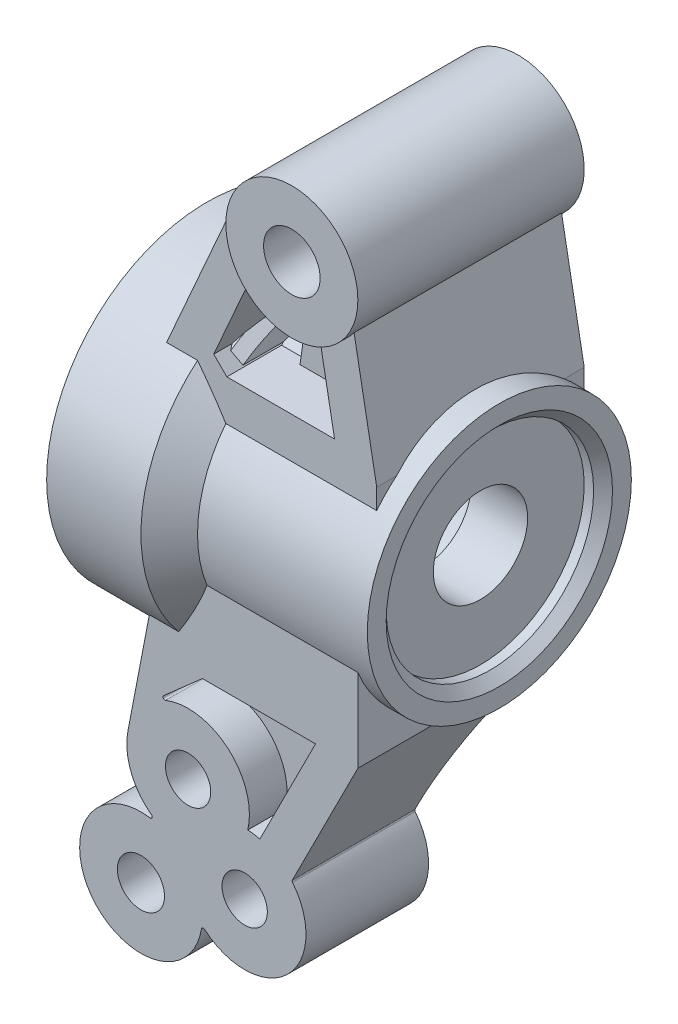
ISO-10303-21;
HEADER;
FILE_DESCRIPTION(('STEP AP214'),'2;1');
FILE_NAME('part.step','',(''),(''),'','','');
FILE_SCHEMA(('AUTOMOTIVE_DESIGN { 1 0 10303 214 1 1 1 1 }'));
ENDSEC;
DATA;
#1=APPLICATION_CONTEXT('core data for automotive mechanical design processes');
#2=APPLICATION_PROTOCOL_DEFINITION('international standard','automotive_design',2000,#1);
#3=PRODUCT_CONTEXT('',#1,'mechanical');
#4=PRODUCT('Part','Part','',(#3));
#5=PRODUCT_RELATED_PRODUCT_CATEGORY('part','',(#4));
#6=PRODUCT_DEFINITION_FORMATION('','',#4);
#7=PRODUCT_DEFINITION_CONTEXT('part definition',#1,'design');
#8=PRODUCT_DEFINITION('design','',#6,#7);
#9=PRODUCT_DEFINITION_SHAPE('','',#8);
#10=(LENGTH_UNIT() NAMED_UNIT(*) SI_UNIT(.MILLI.,.METRE.));
#11=(NAMED_UNIT(*) PLANE_ANGLE_UNIT() SI_UNIT($,.RADIAN.));
#12=(NAMED_UNIT(*) SI_UNIT($,.STERADIAN.) SOLID_ANGLE_UNIT());
#13=UNCERTAINTY_MEASURE_WITH_UNIT(LENGTH_MEASURE(1.E-05),#10,'distance_accuracy_value','');
#14=(GEOMETRIC_REPRESENTATION_CONTEXT(3) GLOBAL_UNCERTAINTY_ASSIGNED_CONTEXT((#13)) GLOBAL_UNIT_ASSIGNED_CONTEXT((#10,
#11,#12)) REPRESENTATION_CONTEXT('',''));
#15=CARTESIAN_POINT('',(0.,0.,0.));
#16=DIRECTION('',(0.,0.,1.));
#17=DIRECTION('',(1.,0.,0.));
#18=AXIS2_PLACEMENT_3D('',#15,#16,#17);
#19=CARTESIAN_POINT('',(-9.,0.,0.));
#20=DIRECTION('',(1.,0.,0.));
#21=DIRECTION('',(0.,0.,-1.));
#22=AXIS2_PLACEMENT_3D('',#19,#20,#21);
#23=CYLINDRICAL_SURFACE('',#22,7.);
#24=CARTESIAN_POINT('',(-9.,0.,0.));
#25=DIRECTION('',(1.,0.,0.));
#26=DIRECTION('',(0.,0.,-1.));
#27=AXIS2_PLACEMENT_3D('',#24,#25,#26);
#28=CIRCLE('',#27,7.);
#29=CARTESIAN_POINT('',(-9.,6.55271087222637,-2.46210889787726));
#30=VERTEX_POINT('',#29);
#31=CARTESIAN_POINT('',(-9.,6.92820323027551,-1.));
#32=VERTEX_POINT('',#31);
#33=EDGE_CURVE('E1059',#30,#32,#28,.T.);
#34=ORIENTED_EDGE('',*,*,#33,.T.);
#35=DIRECTION('',(1.,0.,0.));
#36=VECTOR('',#35,1.);
#37=CARTESIAN_POINT('',(-9.,6.92820323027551,-1.));
#38=LINE('',#37,#36);
#39=CARTESIAN_POINT('',(-7.50549061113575,6.92820323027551,-1.));
#40=VERTEX_POINT('',#39);
#41=EDGE_CURVE('E1551',#32,#40,#38,.T.);
#42=ORIENTED_EDGE('',*,*,#41,.T.);
#43=CARTESIAN_POINT('',(-8.50189581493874,0.,0.));
#44=DIRECTION('',(0.989815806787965,-0.14235402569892,0.));
#45=DIRECTION('',(0.14235402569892,0.989815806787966,0.));
#46=AXIS2_PLACEMENT_3D('',#43,#44,#45);
#47=ELLIPSE('',#46,7.07202284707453,7.);
#48=CARTESIAN_POINT('',(-7.56707424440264,6.5,-2.59807621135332));
#49=VERTEX_POINT('',#48);
#50=EDGE_CURVE('E1515',#40,#49,#47,.F.);
#51=ORIENTED_EDGE('',*,*,#50,.T.);
#52=DIRECTION('',(1.,0.,0.));
#53=VECTOR('',#52,1.);
#54=CARTESIAN_POINT('',(-9.,6.5,-2.59807621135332));
#55=LINE('',#54,#53);
#56=CARTESIAN_POINT('',(-8.94728912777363,6.5,-2.59807621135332));
#57=VERTEX_POINT('',#56);
#58=EDGE_CURVE('E1052',#49,#57,#55,.F.);
#59=ORIENTED_EDGE('',*,*,#58,.T.);
#60=CARTESIAN_POINT('',(-2.44728912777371,0.,0.));
#61=DIRECTION('',(0.707106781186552,0.707106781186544,0.));
#62=DIRECTION('',(0.707106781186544,-0.707106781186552,0.));
#63=AXIS2_PLACEMENT_3D('',#60,#61,#62);
#64=ELLIPSE('',#63,9.89949493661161,7.);
#65=EDGE_CURVE('E822',#30,#57,#64,.F.);
#66=ORIENTED_EDGE('',*,*,#65,.F.);
#67=EDGE_LOOP('',(#34,#42,#51,#59,#66));
#68=FACE_BOUND('',#67,.T.);
#69=ADVANCED_FACE('F350',(#68),#23,.T.);
#70=CARTESIAN_POINT('',(-9.94728912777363,6.5,5.5));
#71=DIRECTION('',(0.914960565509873,-0.40354326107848,0.));
#72=DIRECTION('',(0.40354326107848,0.914960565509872,0.));
#73=AXIS2_PLACEMENT_3D('',#70,#71,#72);
#74=PLANE('',#73);
#75=DIRECTION('',(0.,0.,-1.));
#76=VECTOR('',#75,1.);
#77=CARTESIAN_POINT('',(-7.64855668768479,11.7119555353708,5.5));
#78=LINE('',#77,#76);
#79=CARTESIAN_POINT('',(-7.64855668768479,11.7119555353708,-1.));
#80=VERTEX_POINT('',#79);
#81=CARTESIAN_POINT('',(-7.64855668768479,11.7119555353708,-5.5));
#82=VERTEX_POINT('',#81);
#83=EDGE_CURVE('E354',#80,#82,#78,.T.);
#84=ORIENTED_EDGE('',*,*,#83,.F.);
#85=DIRECTION('',(-0.40354326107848,-0.914960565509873,0.));
#86=VECTOR('',#85,1.);
#87=CARTESIAN_POINT('',(-7.64855668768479,11.7119555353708,-1.));
#88=LINE('',#87,#86);
#89=CARTESIAN_POINT('',(-9.21696138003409,8.15588464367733,-1.));
#90=VERTEX_POINT('',#89);
#91=EDGE_CURVE('E754',#80,#90,#88,.T.);
#92=ORIENTED_EDGE('',*,*,#91,.T.);
#93=CARTESIAN_POINT('',(-15.6672629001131,-6.46899475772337,0.));
#94=DIRECTION('',(0.914960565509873,-0.40354326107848,0.));
#95=DIRECTION('',(-0.40354326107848,-0.914960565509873,0.));
#96=AXIS2_PLACEMENT_3D('',#93,#94,#95);
#97=ELLIPSE('',#96,16.0304863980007,13.1636130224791);
#98=CARTESIAN_POINT('',(-9.50000000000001,7.51414632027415,-3.97336193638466));
#99=VERTEX_POINT('',#98);
#100=EDGE_CURVE('E1475',#90,#99,#97,.F.);
#101=ORIENTED_EDGE('',*,*,#100,.T.);
#102=CARTESIAN_POINT('',(-12.8141134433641,0.,0.));
#103=DIRECTION('',(0.914960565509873,-0.40354326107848,0.));
#104=DIRECTION('',(0.40354326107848,0.914960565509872,0.));
#105=AXIS2_PLACEMENT_3D('',#102,#103,#104);
#106=ELLIPSE('',#105,9.29001786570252,8.5);
#107=CARTESIAN_POINT('',(-9.6412276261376,7.19393849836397,-4.5273887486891));
#108=VERTEX_POINT('',#107);
#109=EDGE_CURVE('E896',#99,#108,#106,.F.);
#110=ORIENTED_EDGE('',*,*,#109,.T.);
#111=DIRECTION('',(0.,0.,-1.));
#112=VECTOR('',#111,1.);
#113=CARTESIAN_POINT('',(-9.6412276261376,7.19393849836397,-5.5));
#114=LINE('',#113,#112);
#115=CARTESIAN_POINT('',(-9.6412276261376,7.19393849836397,-5.5));
#116=VERTEX_POINT('',#115);
#117=EDGE_CURVE('E814',#108,#116,#114,.T.);
#118=ORIENTED_EDGE('',*,*,#117,.T.);
#119=DIRECTION('',(-0.40354326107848,-0.914960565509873,0.));
#120=VECTOR('',#119,1.);
#121=CARTESIAN_POINT('',(-9.94728912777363,6.5,-5.5));
#122=LINE('',#121,#120);
#123=EDGE_CURVE('E784',#82,#116,#122,.T.);
#124=ORIENTED_EDGE('',*,*,#123,.F.);
#125=EDGE_LOOP('',(#84,#92,#101,#110,#118,#124));
#126=FACE_BOUND('',#125,.T.);
#127=ADVANCED_FACE('F891',(#126),#74,.T.);
#128=CARTESIAN_POINT('',(-3.23557189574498,6.5,5.5));
#129=DIRECTION('',(-0.983336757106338,-0.181793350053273,0.));
#130=DIRECTION('',(0.181793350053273,-0.983336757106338,0.));
#131=AXIS2_PLACEMENT_3D('',#128,#129,#130);
#132=PLANE('',#131);
#133=CARTESIAN_POINT('',(-2.03389122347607,0.,0.));
#134=DIRECTION('',(-0.983336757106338,-0.181793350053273,0.));
#135=DIRECTION('',(0.181793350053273,-0.983336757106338,0.));
#136=AXIS2_PLACEMENT_3D('',#133,#134,#135);
#137=ELLIPSE('',#136,7.11861928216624,7.);
#138=CARTESIAN_POINT('',(-3.31473551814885,6.92820323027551,-1.));
#139=VERTEX_POINT('',#138);
#140=CARTESIAN_POINT('',(-3.23557189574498,6.5,-2.59807621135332));
#141=VERTEX_POINT('',#140);
#142=EDGE_CURVE('E763',#139,#141,#137,.T.);
#143=ORIENTED_EDGE('',*,*,#142,.F.);
#144=DIRECTION('',(-0.181793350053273,0.983336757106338,0.));
#145=VECTOR('',#144,1.);
#146=CARTESIAN_POINT('',(-3.23557189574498,6.5,-1.));
#147=LINE('',#146,#145);
#148=CARTESIAN_POINT('',(-4.00193395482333,10.6453220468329,-1.));
#149=VERTEX_POINT('',#148);
#150=EDGE_CURVE('E749',#139,#149,#147,.T.);
#151=ORIENTED_EDGE('',*,*,#150,.T.);
#152=DIRECTION('',(0.,0.,-1.));
#153=VECTOR('',#152,1.);
#154=CARTESIAN_POINT('',(-4.00193395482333,10.6453220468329,5.5));
#155=LINE('',#154,#153);
#156=CARTESIAN_POINT('',(-4.00193395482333,10.6453220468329,-5.5));
#157=VERTEX_POINT('',#156);
#158=EDGE_CURVE('E760',#149,#157,#155,.T.);
#159=ORIENTED_EDGE('',*,*,#158,.T.);
#160=DIRECTION('',(-0.181793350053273,0.983336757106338,0.));
#161=VECTOR('',#160,1.);
#162=CARTESIAN_POINT('',(-3.23557189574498,6.5,-5.5));
#163=LINE('',#162,#161);
#164=CARTESIAN_POINT('',(-3.23557189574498,6.5,-5.5));
#165=VERTEX_POINT('',#164);
#166=EDGE_CURVE('E781',#165,#157,#163,.T.);
#167=ORIENTED_EDGE('',*,*,#166,.F.);
#168=DIRECTION('',(0.,0.,-1.));
#169=VECTOR('',#168,1.);
#170=CARTESIAN_POINT('',(-3.23557189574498,6.5,5.5));
#171=LINE('',#170,#169);
#172=EDGE_CURVE('E773',#141,#165,#171,.T.);
#173=ORIENTED_EDGE('',*,*,#172,.F.);
#174=EDGE_LOOP('',(#143,#151,#159,#167,#173));
#175=FACE_BOUND('',#174,.T.);
#176=ADVANCED_FACE('F758',(#175),#132,.T.);
#177=CARTESIAN_POINT('',(-6.48131785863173,0.,0.));
#178=DIRECTION('',(0.989815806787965,-0.14235402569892,0.));
#179=DIRECTION('',(0.14235402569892,0.989815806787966,0.));
#180=AXIS2_PLACEMENT_3D('',#177,#178,#179);
#181=ELLIPSE('',#180,7.07202284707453,7.);
#182=CARTESIAN_POINT('',(-5.48491265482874,6.92820323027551,-1.));
#183=VERTEX_POINT('',#182);
#184=CARTESIAN_POINT('',(-5.54649628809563,6.5,-2.59807621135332));
#185=VERTEX_POINT('',#184);
#186=EDGE_CURVE('E1516',#183,#185,#181,.F.);
#187=ORIENTED_EDGE('',*,*,#186,.F.);
#188=DIRECTION('',(1.,0.,0.));
#189=VECTOR('',#188,1.);
#190=CARTESIAN_POINT('',(-9.,6.92820323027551,-1.));
#191=LINE('',#190,#189);
#192=EDGE_CURVE('E1546',#183,#139,#191,.T.);
#193=ORIENTED_EDGE('',*,*,#192,.T.);
#194=ORIENTED_EDGE('',*,*,#142,.T.);
#195=EDGE_CURVE('E1049',#141,#185,#55,.F.);
#196=ORIENTED_EDGE('',*,*,#195,.T.);
#197=EDGE_LOOP('',(#187,#193,#194,#196));
#198=FACE_BOUND('',#197,.T.);
#199=ADVANCED_FACE('F1379',(#198),#23,.T.);
#200=CARTESIAN_POINT('',(-9.,0.,0.));
#201=DIRECTION('',(-1.,0.,0.));
#202=DIRECTION('',(0.,0.,1.));
#203=AXIS2_PLACEMENT_3D('',#200,#201,#202);
#204=PLANE('',#203);
#205=DIRECTION('',(0.,1.,0.));
#206=VECTOR('',#205,1.);
#207=CARTESIAN_POINT('',(-9.,0.,-1.));
#208=LINE('',#207,#206);
#209=CARTESIAN_POINT('',(-9.,7.93725393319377,-1.));
#210=VERTEX_POINT('',#209);
#211=EDGE_CURVE('E1554',#32,#210,#208,.T.);
#212=ORIENTED_EDGE('',*,*,#211,.F.);
#213=ORIENTED_EDGE('',*,*,#33,.F.);
#214=DIRECTION('',(0.,0.,1.));
#215=VECTOR('',#214,1.);
#216=CARTESIAN_POINT('',(-9.,6.55271087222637,5.5));
#217=LINE('',#216,#215);
#218=CARTESIAN_POINT('',(-9.,6.55271087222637,-4.58933330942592));
#219=VERTEX_POINT('',#218);
#220=EDGE_CURVE('E1080',#30,#219,#217,.F.);
#221=ORIENTED_EDGE('',*,*,#220,.T.);
#222=CARTESIAN_POINT('',(-9.,0.,0.));
#223=DIRECTION('',(-1.,0.,0.));
#224=DIRECTION('',(0.,0.,1.));
#225=AXIS2_PLACEMENT_3D('',#222,#223,#224);
#226=CIRCLE('',#225,8.);
#227=EDGE_CURVE('E1472',#219,#210,#226,.F.);
#228=ORIENTED_EDGE('',*,*,#227,.T.);
#229=EDGE_LOOP('',(#212,#213,#221,#228));
#230=FACE_BOUND('',#229,.T.);
#231=ADVANCED_FACE('F1388',(#230),#204,.F.);
#232=CARTESIAN_POINT('',(-9.50000000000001,0.,0.));
#233=DIRECTION('',(-1.,0.,0.));
#234=DIRECTION('',(0.,0.,1.));
#235=AXIS2_PLACEMENT_3D('',#232,#233,#234);
#236=CONICAL_SURFACE('',#235,8.5,0.785398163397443);
#237=ORIENTED_EDGE('',*,*,#100,.F.);
#238=CARTESIAN_POINT('',(-11.4924983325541,10.4447365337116,-1.));
#239=CARTESIAN_POINT('',(-11.1021142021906,10.0525484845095,-1.));
#240=CARTESIAN_POINT('',(-10.7118125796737,9.66027816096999,-1.));
#241=CARTESIAN_POINT('',(-9.93150138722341,8.87544830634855,-1.));
#242=CARTESIAN_POINT('',(-9.54149181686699,8.48288877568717,-1.));
#243=CARTESIAN_POINT('',(-8.76189019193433,7.69735426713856,-1.));
#244=CARTESIAN_POINT('',(-8.37229813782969,7.30437928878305,-1.));
#245=CARTESIAN_POINT('',(-7.78841570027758,6.71441573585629,-1.));
#246=CARTESIAN_POINT('',(-7.59387235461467,6.51767756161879,-1.));
#247=CARTESIAN_POINT('',(-7.20501203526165,6.12397745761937,-1.));
#248=CARTESIAN_POINT('',(-7.01069506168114,5.92701552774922,-1.));
#249=CARTESIAN_POINT('',(-6.81652023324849,5.72991340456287,-1.));
#250=B_SPLINE_CURVE_WITH_KNOTS('',3,(#238,#239,#240,#241,#242,#243,#244,#245,#246,#247,#248,
#249),.UNSPECIFIED.,.F.,.F.,(4,2,2,2,2,4),(0.,1.66009082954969,3.32017924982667,
4.98026954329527,5.8103158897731,6.64036263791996),.UNSPECIFIED.);
#251=EDGE_CURVE('E1557',#90,#210,#250,.T.);
#252=ORIENTED_EDGE('',*,*,#251,.T.);
#253=ORIENTED_EDGE('',*,*,#227,.F.);
#254=CARTESIAN_POINT('',(-9.50000000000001,7.05271087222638,-4.74439346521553));
#255=CARTESIAN_POINT('',(-9.41660316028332,6.96931403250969,-4.71895971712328));
#256=CARTESIAN_POINT('',(-9.33323807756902,6.88594894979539,-4.69332116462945));
#257=CARTESIAN_POINT('',(-9.16657141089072,6.71928228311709,-4.6416344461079));
#258=CARTESIAN_POINT('',(-9.08326982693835,6.63598069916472,-4.61558628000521));
#259=CARTESIAN_POINT('',(-9.,6.55271087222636,-4.58933330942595));
#260=B_SPLINE_CURVE_WITH_KNOTS('',3,(#254,#255,#256,#257,#258,#259),.UNSPECIFIED.,.F.,.F.,(4,2,
4),(0.,0.361954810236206,0.72390968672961),.UNSPECIFIED.);
#261=CARTESIAN_POINT('',(-9.50000000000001,7.05271087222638,-4.74439346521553));
#262=VERTEX_POINT('',#261);
#263=EDGE_CURVE('E1479',#262,#219,#260,.T.);
#264=ORIENTED_EDGE('',*,*,#263,.F.);
#265=CARTESIAN_POINT('',(-9.50000000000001,0.,0.));
#266=DIRECTION('',(-1.,0.,0.));
#267=DIRECTION('',(0.,0.,1.));
#268=AXIS2_PLACEMENT_3D('',#265,#266,#267);
#269=CIRCLE('',#268,8.5);
#270=EDGE_CURVE('E1464',#99,#262,#269,.T.);
#271=ORIENTED_EDGE('',*,*,#270,.F.);
#272=EDGE_LOOP('',(#237,#252,#253,#264,#271));
#273=FACE_BOUND('',#272,.T.);
#274=ADVANCED_FACE('F1647',(#273),#236,.T.);
#275=CARTESIAN_POINT('',(-6.79702438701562,11.8543095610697,3.));
#276=DIRECTION('',(0.989815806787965,-0.14235402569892,0.));
#277=DIRECTION('',(0.14235402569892,0.989815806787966,0.));
#278=AXIS2_PLACEMENT_3D('',#275,#276,#277);
#279=PLANE('',#278);
#280=DIRECTION('',(-0.14235402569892,-0.989815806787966,0.));
#281=VECTOR('',#280,1.);
#282=CARTESIAN_POINT('',(-6.79702438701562,11.8543095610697,-1.));
#283=LINE('',#282,#281);
#284=CARTESIAN_POINT('',(-6.91021924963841,11.0672432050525,-1.));
#285=VERTEX_POINT('',#284);
#286=EDGE_CURVE('E1548',#285,#40,#283,.T.);
#287=ORIENTED_EDGE('',*,*,#286,.F.);
#288=DIRECTION('',(0.,0.,-1.));
#289=VECTOR('',#288,1.);
#290=CARTESIAN_POINT('',(-6.91021924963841,11.0672432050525,5.5));
#291=LINE('',#290,#289);
#292=CARTESIAN_POINT('',(-6.91021924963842,11.0672432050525,-3.));
#293=VERTEX_POINT('',#292);
#294=EDGE_CURVE('E1101',#285,#293,#291,.T.);
#295=ORIENTED_EDGE('',*,*,#294,.T.);
#296=DIRECTION('',(-0.14235402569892,-0.989815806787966,0.));
#297=VECTOR('',#296,1.);
#298=CARTESIAN_POINT('',(-6.79702438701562,11.8543095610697,-3.));
#299=LINE('',#298,#297);
#300=CARTESIAN_POINT('',(-7.56707424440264,6.5,-3.));
#301=VERTEX_POINT('',#300);
#302=EDGE_CURVE('E1124',#293,#301,#299,.T.);
#303=ORIENTED_EDGE('',*,*,#302,.T.);
#304=DIRECTION('',(0.,0.,-1.));
#305=VECTOR('',#304,1.);
#306=CARTESIAN_POINT('',(-7.56707424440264,6.5,5.5));
#307=LINE('',#306,#305);
#308=EDGE_CURVE('E1104',#49,#301,#307,.T.);
#309=ORIENTED_EDGE('',*,*,#308,.F.);
#310=ORIENTED_EDGE('',*,*,#50,.F.);
#311=EDGE_LOOP('',(#287,#295,#303,#309,#310));
#312=FACE_BOUND('',#311,.T.);
#313=ADVANCED_FACE('F1695',(#312),#279,.F.);
#314=CARTESIAN_POINT('',(-4.81739277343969,11.5696015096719,3.));
#315=DIRECTION('',(0.989815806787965,-0.14235402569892,0.));
#316=DIRECTION('',(0.14235402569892,0.989815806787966,0.));
#317=AXIS2_PLACEMENT_3D('',#314,#315,#316);
#318=PLANE('',#317);
#319=DIRECTION('',(0.,0.,-1.));
#320=VECTOR('',#319,1.);
#321=CARTESIAN_POINT('',(-4.97120443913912,10.5001184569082,5.5));
#322=LINE('',#321,#320);
#323=CARTESIAN_POINT('',(-4.97120443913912,10.5001184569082,-1.));
#324=VERTEX_POINT('',#323);
#325=CARTESIAN_POINT('',(-4.97120443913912,10.5001184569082,-3.));
#326=VERTEX_POINT('',#325);
#327=EDGE_CURVE('E1108',#324,#326,#322,.T.);
#328=ORIENTED_EDGE('',*,*,#327,.F.);
#329=DIRECTION('',(-0.14235402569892,-0.989815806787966,0.));
#330=VECTOR('',#329,1.);
#331=CARTESIAN_POINT('',(-4.81739277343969,11.5696015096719,-1.));
#332=LINE('',#331,#330);
#333=EDGE_CURVE('E360',#324,#183,#332,.T.);
#334=ORIENTED_EDGE('',*,*,#333,.T.);
#335=ORIENTED_EDGE('',*,*,#186,.T.);
#336=DIRECTION('',(0.,0.,-1.));
#337=VECTOR('',#336,1.);
#338=CARTESIAN_POINT('',(-5.54649628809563,6.5,5.5));
#339=LINE('',#338,#337);
#340=CARTESIAN_POINT('',(-5.54649628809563,6.5,-3.));
#341=VERTEX_POINT('',#340);
#342=EDGE_CURVE('E1112',#185,#341,#339,.T.);
#343=ORIENTED_EDGE('',*,*,#342,.T.);
#344=DIRECTION('',(-0.14235402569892,-0.989815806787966,0.));
#345=VECTOR('',#344,1.);
#346=CARTESIAN_POINT('',(-4.81739277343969,11.5696015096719,-3.));
#347=LINE('',#346,#345);
#348=EDGE_CURVE('E1121',#326,#341,#347,.T.);
#349=ORIENTED_EDGE('',*,*,#348,.F.);
#350=EDGE_LOOP('',(#328,#334,#335,#343,#349));
#351=FACE_BOUND('',#350,.T.);
#352=ADVANCED_FACE('F1690',(#351),#318,.T.);
#353=CARTESIAN_POINT('',(-3.24104145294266,-7.,6.5));
#354=DIRECTION('',(0.,-1.,0.));
#355=DIRECTION('',(1.,0.,0.));
#356=AXIS2_PLACEMENT_3D('',#353,#354,#355);
#357=PLANE('',#356);
#358=DIRECTION('',(0.,0.,-1.));
#359=VECTOR('',#358,1.);
#360=CARTESIAN_POINT('',(-3.24104145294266,-7.,6.5));
#361=LINE('',#360,#359);
#362=CARTESIAN_POINT('',(-3.24104145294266,-7.,1.5));
#363=VERTEX_POINT('',#362);
#364=CARTESIAN_POINT('',(-3.24104145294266,-7.,0.));
#365=VERTEX_POINT('',#364);
#366=EDGE_CURVE('E976',#363,#365,#361,.T.);
#367=ORIENTED_EDGE('',*,*,#366,.F.);
#368=DIRECTION('',(-1.,0.,0.));
#369=VECTOR('',#368,1.);
#370=CARTESIAN_POINT('',(-3.24104145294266,-7.,1.5));
#371=LINE('',#370,#369);
#372=CARTESIAN_POINT('',(-9.15891053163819,-7.,1.5));
#373=VERTEX_POINT('',#372);
#374=EDGE_CURVE('E1132',#363,#373,#371,.T.);
#375=ORIENTED_EDGE('',*,*,#374,.T.);
#376=CARTESIAN_POINT('',(-9.24104145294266,-7.,1.8527496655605));
#377=CARTESIAN_POINT('',(-9.20225318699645,-7.,1.70126184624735));
#378=CARTESIAN_POINT('',(-9.16767538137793,-7.,1.54865312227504));
#379=CARTESIAN_POINT('',(-9.10779991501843,-7.,1.24225999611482));
#380=CARTESIAN_POINT('',(-9.08246604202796,-7.,1.08848264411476));
#381=CARTESIAN_POINT('',(-9.04161406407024,-7.,0.779574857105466));
#382=CARTESIAN_POINT('',(-9.02609826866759,-7.,0.624444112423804));
#383=CARTESIAN_POINT('',(-9.0052445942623,-7.,0.312884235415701));
#384=CARTESIAN_POINT('',(-8.99994742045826,-7.,0.156452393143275));
#385=CARTESIAN_POINT('',(-9.00000000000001,-7.,0.));
#386=B_SPLINE_CURVE_WITH_KNOTS('',3,(#376,#377,#378,#379,#380,#381,#382,#383,#384,#385),
.UNSPECIFIED.,.F.,.F.,(4,2,2,2,4),(0.,0.469125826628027,0.936393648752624,1.40377134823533,
1.87300700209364),.UNSPECIFIED.);
#387=CARTESIAN_POINT('',(-9.,-7.,0.));
#388=VERTEX_POINT('',#387);
#389=EDGE_CURVE('E1223',#373,#388,#386,.T.);
#390=ORIENTED_EDGE('',*,*,#389,.T.);
#391=DIRECTION('',(-1.,0.,0.));
#392=VECTOR('',#391,1.);
#393=CARTESIAN_POINT('',(-3.24104145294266,-7.,0.));
#394=LINE('',#393,#392);
#395=EDGE_CURVE('E1004',#365,#388,#394,.T.);
#396=ORIENTED_EDGE('',*,*,#395,.F.);
#397=EDGE_LOOP('',(#367,#375,#390,#396));
#398=FACE_BOUND('',#397,.T.);
#399=ADVANCED_FACE('F1245',(#398),#357,.T.);
#400=CARTESIAN_POINT('',(-9.24104145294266,-7.,6.5));
#401=DIRECTION('',(0.661049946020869,-0.750341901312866,0.));
#402=DIRECTION('',(0.750341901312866,0.661049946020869,0.));
#403=AXIS2_PLACEMENT_3D('',#400,#401,#402);
#404=PLANE('',#403);
#405=CARTESIAN_POINT('',(-1.29550974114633,0.,0.));
#406=DIRECTION('',(0.661049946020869,-0.750341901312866,0.));
#407=DIRECTION('',(0.750341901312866,0.661049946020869,0.));
#408=AXIS2_PLACEMENT_3D('',#405,#406,#407);
#409=ELLIPSE('',#408,12.8583324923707,8.5);
#410=CARTESIAN_POINT('',(-10.7753368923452,-8.35171168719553,-1.58079470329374));
#411=VERTEX_POINT('',#410);
#412=CARTESIAN_POINT('',(-10.792236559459,-8.36660026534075,1.5));
#413=VERTEX_POINT('',#412);
#414=EDGE_CURVE('E1074',#411,#413,#409,.F.);
#415=ORIENTED_EDGE('',*,*,#414,.T.);
#416=DIRECTION('',(-0.750341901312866,-0.661049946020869,0.));
#417=VECTOR('',#416,1.);
#418=CARTESIAN_POINT('',(-9.24104145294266,-7.,1.5));
#419=LINE('',#418,#417);
#420=CARTESIAN_POINT('',(-11.2928909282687,-8.80767591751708,1.5));
#421=VERTEX_POINT('',#420);
#422=EDGE_CURVE('E1129',#413,#421,#419,.T.);
#423=ORIENTED_EDGE('',*,*,#422,.T.);
#424=DIRECTION('',(0.,0.,-1.));
#425=VECTOR('',#424,1.);
#426=CARTESIAN_POINT('',(-11.2928909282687,-8.80767591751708,6.5));
#427=LINE('',#426,#425);
#428=CARTESIAN_POINT('',(-11.2928909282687,-8.80767591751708,-1.30541004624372));
#429=VERTEX_POINT('',#428);
#430=EDGE_CURVE('E983',#421,#429,#427,.T.);
#431=ORIENTED_EDGE('',*,*,#430,.T.);
#432=CARTESIAN_POINT('',(-16.9002242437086,-13.7477270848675,-10.));
#433=DIRECTION('',(0.661049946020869,-0.750341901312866,0.));
#434=DIRECTION('',(0.750341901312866,0.661049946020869,0.));
#435=AXIS2_PLACEMENT_3D('',#432,#433,#434);
#436=ELLIPSE('',#435,15.1274499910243,10.);
#437=EDGE_CURVE('E1451',#429,#411,#436,.F.);
#438=ORIENTED_EDGE('',*,*,#437,.T.);
#439=EDGE_LOOP('',(#415,#423,#431,#438));
#440=FACE_BOUND('',#439,.T.);
#441=ADVANCED_FACE('F1449',(#440),#404,.T.);
#442=CARTESIAN_POINT('',(-7.,-16.,6.5));
#443=DIRECTION('',(0.,0.,-1.));
#444=DIRECTION('',(-1.,0.,0.));
#445=AXIS2_PLACEMENT_3D('',#442,#443,#444);
#446=CYLINDRICAL_SURFACE('',#445,3.25);
#447=DIRECTION('',(0.,0.,-1.));
#448=VECTOR('',#447,1.);
#449=CARTESIAN_POINT('',(-6.83867522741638,-12.7540064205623,6.5));
#450=LINE('',#449,#448);
#451=CARTESIAN_POINT('',(-6.83867522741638,-12.7540064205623,1.5));
#452=VERTEX_POINT('',#451);
#453=CARTESIAN_POINT('',(-6.83867522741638,-12.7540064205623,-0.0494965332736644));
#454=VERTEX_POINT('',#453);
#455=EDGE_CURVE('E990',#452,#454,#450,.T.);
#456=ORIENTED_EDGE('',*,*,#455,.F.);
#457=CARTESIAN_POINT('',(-7.,-16.,1.5));
#458=DIRECTION('',(0.,0.,-1.));
#459=DIRECTION('',(1.,0.,0.));
#460=AXIS2_PLACEMENT_3D('',#457,#458,#459);
#461=CIRCLE('',#460,3.25);
#462=CARTESIAN_POINT('',(-6.19860643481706,-12.8503542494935,1.5));
#463=VERTEX_POINT('',#462);
#464=EDGE_CURVE('E1138',#452,#463,#461,.T.);
#465=ORIENTED_EDGE('',*,*,#464,.T.);
#466=DIRECTION('',(0.,0.,-1.));
#467=VECTOR('',#466,1.);
#468=CARTESIAN_POINT('',(-6.19860643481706,-12.8503542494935,6.5));
#469=LINE('',#468,#467);
#470=CARTESIAN_POINT('',(-6.19860643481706,-12.8503542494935,-0.0403452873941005));
#471=VERTEX_POINT('',#470);
#472=EDGE_CURVE('E972',#463,#471,#469,.T.);
#473=ORIENTED_EDGE('',*,*,#472,.T.);
#474=CARTESIAN_POINT('',(-6.19860643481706,-12.8503542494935,-0.0403452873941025));
#475=CARTESIAN_POINT('',(-6.25102574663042,-12.8370155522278,-0.0415481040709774));
#476=CARTESIAN_POINT('',(-6.30378060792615,-12.8249871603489,-0.0426578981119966));
#477=CARTESIAN_POINT('',(-6.40969608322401,-12.8036034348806,-0.0446622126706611));
#478=CARTESIAN_POINT('',(-6.46285535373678,-12.7942414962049,-0.0455572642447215));
#479=CARTESIAN_POINT('',(-6.56957768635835,-12.778176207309,-0.0471091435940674));
#480=CARTESIAN_POINT('',(-6.62314074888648,-12.77147285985,-0.0477659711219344));
#481=CARTESIAN_POINT('',(-6.73067114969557,-12.7607268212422,-0.0488264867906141));
#482=CARTESIAN_POINT('',(-6.78463916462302,-12.7566908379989,-0.0492295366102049));
#483=CARTESIAN_POINT('',(-6.83867522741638,-12.7540064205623,-0.0494965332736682));
#484=B_SPLINE_CURVE_WITH_KNOTS('',3,(#474,#475,#476,#477,#478,#479,#480,#481,#482,#483),
.UNSPECIFIED.,.F.,.F.,(4,2,2,2,4),(0.,0.162292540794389,0.324179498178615,0.486066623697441,
0.648359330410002),.UNSPECIFIED.);
#485=EDGE_CURVE('E1263',#471,#454,#484,.T.);
#486=ORIENTED_EDGE('',*,*,#485,.T.);
#487=EDGE_LOOP('',(#456,#465,#473,#486));
#488=FACE_BOUND('',#487,.T.);
#489=ADVANCED_FACE('F1259',(#488),#446,.T.);
#490=CARTESIAN_POINT('',(-3.24104145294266,-7.,6.5));
#491=DIRECTION('',(-0.892442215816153,0.451161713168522,0.));
#492=DIRECTION('',(-0.451161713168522,-0.892442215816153,0.));
#493=AXIS2_PLACEMENT_3D('',#490,#491,#492);
#494=PLANE('',#493);
#495=ORIENTED_EDGE('',*,*,#472,.F.);
#496=DIRECTION('',(0.451161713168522,0.892442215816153,0.));
#497=VECTOR('',#496,1.);
#498=CARTESIAN_POINT('',(-6.19860643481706,-12.8503542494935,1.5));
#499=LINE('',#498,#497);
#500=EDGE_CURVE('E1135',#463,#363,#499,.T.);
#501=ORIENTED_EDGE('',*,*,#500,.T.);
#502=ORIENTED_EDGE('',*,*,#366,.T.);
#503=CARTESIAN_POINT('',(0.297710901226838,0.,0.));
#504=DIRECTION('',(-0.892442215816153,0.451161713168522,0.));
#505=DIRECTION('',(0.451161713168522,0.892442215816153,0.));
#506=AXIS2_PLACEMENT_3D('',#503,#504,#505);
#507=ELLIPSE('',#506,7.84364508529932,7.);
#508=CARTESIAN_POINT('',(-2.56404213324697,-5.66082879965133,-4.11764705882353));
#509=VERTEX_POINT('',#508);
#510=EDGE_CURVE('E1410',#509,#365,#507,.T.);
#511=ORIENTED_EDGE('',*,*,#510,.F.);
#512=CARTESIAN_POINT('',(-6.65226075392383,-13.7477270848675,-10.));
#513=DIRECTION('',(-0.892442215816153,0.451161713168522,0.));
#514=DIRECTION('',(0.451161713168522,0.892442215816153,0.));
#515=AXIS2_PLACEMENT_3D('',#512,#513,#514);
#516=ELLIPSE('',#515,11.2052072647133,10.);
#517=EDGE_CURVE('E1272',#509,#471,#516,.F.);
#518=ORIENTED_EDGE('',*,*,#517,.T.);
#519=EDGE_LOOP('',(#495,#501,#502,#511,#518));
#520=FACE_BOUND('',#519,.T.);
#521=ADVANCED_FACE('F1253',(#520),#494,.T.);
#522=CARTESIAN_POINT('',(-11.2267859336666,-8.88271010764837,6.5));
#523=DIRECTION('',(0.,0.,-1.));
#524=DIRECTION('',(-1.,0.,0.));
#525=AXIS2_PLACEMENT_3D('',#522,#523,#524);
#526=CYLINDRICAL_SURFACE('',#525,0.0999999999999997);
#527=ORIENTED_EDGE('',*,*,#430,.F.);
#528=CARTESIAN_POINT('',(-11.2267859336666,-8.88271010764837,1.5));
#529=DIRECTION('',(0.,0.,1.));
#530=DIRECTION('',(1.,0.,0.));
#531=AXIS2_PLACEMENT_3D('',#528,#529,#530);
#532=CIRCLE('',#531,0.1);
#533=CARTESIAN_POINT('',(-11.1901654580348,-8.97576353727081,1.5));
#534=VERTEX_POINT('',#533);
#535=EDGE_CURVE('E1144',#421,#534,#532,.T.);
#536=ORIENTED_EDGE('',*,*,#535,.T.);
#537=DIRECTION('',(0.,0.,-1.));
#538=VECTOR('',#537,1.);
#539=CARTESIAN_POINT('',(-11.1901654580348,-8.97576353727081,6.5));
#540=LINE('',#539,#538);
#541=CARTESIAN_POINT('',(-11.1901654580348,-8.97576353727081,-1.21203300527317));
#542=VERTEX_POINT('',#541);
#543=EDGE_CURVE('E987',#534,#542,#540,.T.);
#544=ORIENTED_EDGE('',*,*,#543,.T.);
#545=CARTESIAN_POINT('',(-11.1901654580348,-8.97576353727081,-1.21203300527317));
#546=CARTESIAN_POINT('',(-11.194741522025,-8.97757101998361,-1.21105162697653));
#547=CARTESIAN_POINT('',(-11.1994912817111,-8.97904364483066,-1.21025260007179));
#548=CARTESIAN_POINT('',(-11.2091997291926,-8.98127579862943,-1.20904190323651));
#549=CARTESIAN_POINT('',(-11.2141582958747,-8.98203573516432,-1.20863001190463));
#550=CARTESIAN_POINT('',(-11.2241595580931,-8.98280192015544,-1.2082147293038));
#551=CARTESIAN_POINT('',(-11.229202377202,-8.98280694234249,-1.20821200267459));
#552=CARTESIAN_POINT('',(-11.2392117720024,-8.98206177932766,-1.2086158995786));
#553=CARTESIAN_POINT('',(-11.2441783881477,-8.98131200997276,-1.20902229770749));
#554=CARTESIAN_POINT('',(-11.2538405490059,-8.97910682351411,-1.21021830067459));
#555=CARTESIAN_POINT('',(-11.2585385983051,-8.97765982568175,-1.21100333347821));
#556=CARTESIAN_POINT('',(-11.2676123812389,-8.97412635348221,-1.21292198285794));
#557=CARTESIAN_POINT('',(-11.2719879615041,-8.972039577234,-1.21405576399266));
#558=CARTESIAN_POINT('',(-11.2805391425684,-8.96718490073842,-1.21669626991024));
#559=CARTESIAN_POINT('',(-11.284692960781,-8.96438754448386,-1.21821914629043));
#560=CARTESIAN_POINT('',(-11.2924693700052,-8.95827578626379,-1.22155091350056));
#561=CARTESIAN_POINT('',(-11.296091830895,-8.95496125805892,-1.22335987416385));
#562=CARTESIAN_POINT('',(-11.3031068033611,-8.94754688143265,-1.22741260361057));
#563=CARTESIAN_POINT('',(-11.3064359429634,-8.94340118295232,-1.2296820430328));
#564=CARTESIAN_POINT('',(-11.312354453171,-8.9347258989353,-1.23443988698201));
#565=CARTESIAN_POINT('',(-11.3149434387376,-8.93019611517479,-1.23692840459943));
#566=CARTESIAN_POINT('',(-11.3196347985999,-8.92029518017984,-1.24237835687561));
#567=CARTESIAN_POINT('',(-11.3216390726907,-8.91488885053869,-1.24536042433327));
#568=CARTESIAN_POINT('',(-11.3246866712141,-8.90387874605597,-1.25144738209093));
#569=CARTESIAN_POINT('',(-11.3257296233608,-8.89827489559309,-1.25455231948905));
#570=CARTESIAN_POINT('',(-11.3269096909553,-8.8864445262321,-1.26112238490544));
#571=CARTESIAN_POINT('',(-11.3269476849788,-8.88021094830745,-1.26459291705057));
#572=CARTESIAN_POINT('',(-11.3258670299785,-8.86782284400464,-1.2715072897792));
#573=CARTESIAN_POINT('',(-11.3247473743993,-8.86166839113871,-1.2749511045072));
#574=CARTESIAN_POINT('',(-11.3213011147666,-8.84941220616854,-1.28182574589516));
#575=CARTESIAN_POINT('',(-11.3189359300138,-8.8433189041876,-1.2852523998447));
#576=CARTESIAN_POINT('',(-11.3129948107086,-8.83161311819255,-1.29185046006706));
#577=CARTESIAN_POINT('',(-11.3094219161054,-8.82599947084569,-1.2950224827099));
#578=CARTESIAN_POINT('',(-11.3034308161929,-8.81841069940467,-1.29931915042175));
#579=CARTESIAN_POINT('',(-11.3014766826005,-8.81614938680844,-1.30060072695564));
#580=CARTESIAN_POINT('',(-11.2973478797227,-8.81178753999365,-1.30307484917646));
#581=CARTESIAN_POINT('',(-11.2951733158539,-8.80968692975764,-1.30426743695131));
#582=CARTESIAN_POINT('',(-11.2928909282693,-8.80767591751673,-1.30541004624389));
#583=B_SPLINE_CURVE_WITH_KNOTS('',3,(#545,#546,#547,#548,#549,#550,#551,#552,#553,#554,#555,
#556,#557,#558,#559,#560,#561,#562,#563,#564,#565,#566,#567,#568,#569,#570,#571,#572,#573,#574,
#575,#576,#577,#578,#579,#580,#581,#582),.UNSPECIFIED.,.F.,.F.,(4,2,2,2,2,2,2,2,2,2,2,2,2,2,2,2,
2,2,4),(0.,0.0150377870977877,0.0300669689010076,0.0451205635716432,0.0601658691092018,
0.0750338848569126,0.0899089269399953,0.105547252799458,0.121189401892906,0.138462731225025,
0.155745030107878,0.175138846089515,0.194540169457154,0.215848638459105,0.237175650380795,
0.259205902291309,0.281181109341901,0.290925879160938,0.300666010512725),.UNSPECIFIED.);
#584=EDGE_CURVE('E1295',#542,#429,#583,.T.);
#585=ORIENTED_EDGE('',*,*,#584,.T.);
#586=EDGE_LOOP('',(#527,#536,#544,#585));
#587=FACE_BOUND('',#586,.T.);
#588=ADVANCED_FACE('F1445',(#587),#526,.F.);
#589=CARTESIAN_POINT('',(-10.,-12.,6.5));
#590=DIRECTION('',(0.,0.,-1.));
#591=DIRECTION('',(-1.,0.,0.));
#592=AXIS2_PLACEMENT_3D('',#589,#590,#591);
#593=CYLINDRICAL_SURFACE('',#592,3.25);
#594=ORIENTED_EDGE('',*,*,#543,.F.);
#595=CARTESIAN_POINT('',(-10.,-12.,1.5));
#596=DIRECTION('',(0.,0.,-1.));
#597=DIRECTION('',(1.,0.,0.));
#598=AXIS2_PLACEMENT_3D('',#595,#596,#597);
#599=CIRCLE('',#598,3.25);
#600=EDGE_CURVE('E1141',#534,#452,#599,.T.);
#601=ORIENTED_EDGE('',*,*,#600,.T.);
#602=ORIENTED_EDGE('',*,*,#455,.T.);
#603=CARTESIAN_POINT('',(-6.83867522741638,-12.7540064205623,-0.0494965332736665));
#604=CARTESIAN_POINT('',(-6.81780387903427,-12.6665513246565,-0.0582187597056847));
#605=CARTESIAN_POINT('',(-6.80061548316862,-12.5783527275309,-0.0682025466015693));
#606=CARTESIAN_POINT('',(-6.77361401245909,-12.4011744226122,-0.0906757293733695));
#607=CARTESIAN_POINT('',(-6.76379885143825,-12.3121949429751,-0.10316441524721));
#608=CARTESIAN_POINT('',(-6.75156208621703,-12.1344103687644,-0.130588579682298));
#609=CARTESIAN_POINT('',(-6.74911569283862,-12.0456056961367,-0.145515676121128));
#610=CARTESIAN_POINT('',(-6.75145126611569,-11.8685447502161,-0.177740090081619));
#611=CARTESIAN_POINT('',(-6.75623350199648,-11.7802884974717,-0.195037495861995));
#612=CARTESIAN_POINT('',(-6.7812273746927,-11.5173972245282,-0.250255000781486));
#613=CARTESIAN_POINT('',(-6.81206771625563,-11.3443575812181,-0.291544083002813));
#614=CARTESIAN_POINT('',(-6.90042863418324,-11.0072195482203,-0.381259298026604));
#615=CARTESIAN_POINT('',(-6.95796685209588,-10.8431271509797,-0.429690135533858));
#616=CARTESIAN_POINT('',(-7.10077929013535,-10.5202915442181,-0.533550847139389));
#617=CARTESIAN_POINT('',(-7.18717829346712,-10.362115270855,-0.58919680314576));
#618=CARTESIAN_POINT('',(-7.38446693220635,-10.0625575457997,-0.702407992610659));
#619=CARTESIAN_POINT('',(-7.49536832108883,-9.92118420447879,-0.759974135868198));
#620=CARTESIAN_POINT('',(-7.74698163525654,-9.64994522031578,-0.876879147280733));
#621=CARTESIAN_POINT('',(-7.8891256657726,-9.52135499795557,-0.936103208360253));
#622=CARTESIAN_POINT('',(-8.19575895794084,-9.29001593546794,-1.0476069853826));
#623=CARTESIAN_POINT('',(-8.36024893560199,-9.18726792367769,-1.09988647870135));
#624=CARTESIAN_POINT('',(-8.61807493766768,-9.05691717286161,-1.1683170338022));
#625=CARTESIAN_POINT('',(-8.7045149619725,-9.0178389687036,-1.18922400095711));
#626=CARTESIAN_POINT('',(-8.88114244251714,-8.94718382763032,-1.2275203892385));
#627=CARTESIAN_POINT('',(-8.97132787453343,-8.91560289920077,-1.24491168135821));
#628=CARTESIAN_POINT('',(-9.1546744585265,-8.8604005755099,-1.27560668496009));
#629=CARTESIAN_POINT('',(-9.2478323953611,-8.83677087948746,-1.28891465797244));
#630=CARTESIAN_POINT('',(-9.43638980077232,-8.79779678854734,-1.31100150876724));
#631=CARTESIAN_POINT('',(-9.53178887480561,-8.78245094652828,-1.31978117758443));
#632=CARTESIAN_POINT('',(-9.71196401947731,-8.76168092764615,-1.3316976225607));
#633=CARTESIAN_POINT('',(-9.79658963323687,-8.75526202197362,-1.33539934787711));
#634=CARTESIAN_POINT('',(-9.96616116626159,-8.74906920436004,-1.33897043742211));
#635=CARTESIAN_POINT('',(-10.0511070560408,-8.74929469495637,-1.33884014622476));
#636=CARTESIAN_POINT('',(-10.2206331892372,-8.75638800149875,-1.33475036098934));
#637=CARTESIAN_POINT('',(-10.3052134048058,-8.76325631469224,-1.33079058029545));
#638=CARTESIAN_POINT('',(-10.4732998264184,-8.78353385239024,-1.31916375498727));
#639=CARTESIAN_POINT('',(-10.55680631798,-8.79694129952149,-1.31149771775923));
#640=CARTESIAN_POINT('',(-10.7341218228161,-8.83252880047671,-1.29130798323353));
#641=CARTESIAN_POINT('',(-10.8276708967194,-8.8556983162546,-1.27824146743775));
#642=CARTESIAN_POINT('',(-11.0114992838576,-8.90992497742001,-1.24805281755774));
#643=CARTESIAN_POINT('',(-11.1017868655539,-8.94096030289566,-1.2309419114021));
#644=CARTESIAN_POINT('',(-11.1901654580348,-8.97576353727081,-1.21203300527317));
#645=B_SPLINE_CURVE_WITH_KNOTS('',3,(#603,#604,#605,#606,#607,#608,#609,#610,#611,#612,#613,
#614,#615,#616,#617,#618,#619,#620,#621,#622,#623,#624,#625,#626,#627,#628,#629,#630,#631,#632,
#633,#634,#635,#636,#637,#638,#639,#640,#641,#642,#643,#644),.UNSPECIFIED.,.F.,.F.,(4,2,2,2,2,2,
2,2,2,2,2,2,2,2,2,2,2,2,2,2,4),(0.,0.270898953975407,0.541721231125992,0.811631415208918,
1.08155165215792,1.620544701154,2.15989441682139,2.72335188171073,3.28708021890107,
3.88611783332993,4.48517464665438,4.77624570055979,5.06716144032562,5.35777252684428,
5.64833283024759,5.90284464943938,6.15733358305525,6.41184156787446,6.66628041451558,
6.95757777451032,7.24807574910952),.UNSPECIFIED.);
#646=EDGE_CURVE('E1271',#454,#542,#645,.T.);
#647=ORIENTED_EDGE('',*,*,#646,.T.);
#648=EDGE_LOOP('',(#594,#601,#602,#647));
#649=FACE_BOUND('',#648,.T.);
#650=ADVANCED_FACE('F1441',(#649),#593,.T.);
#651=CARTESIAN_POINT('',(-15.5,0.,0.));
#652=DIRECTION('',(1.,0.,0.));
#653=DIRECTION('',(0.,0.,-1.));
#654=AXIS2_PLACEMENT_3D('',#651,#652,#653);
#655=CYLINDRICAL_SURFACE('',#654,8.5);
#656=CARTESIAN_POINT('',(-15.5,0.,0.));
#657=DIRECTION('',(-1.,0.,0.));
#658=DIRECTION('',(0.,0.,1.));
#659=AXIS2_PLACEMENT_3D('',#656,#657,#658);
#660=CIRCLE('',#659,8.5);
#661=CARTESIAN_POINT('',(-15.5,0.,8.5));
#662=VERTEX_POINT('',#661);
#663=EDGE_CURVE('E1084',#662,#662,#660,.T.);
#664=ORIENTED_EDGE('',*,*,#663,.F.);
#665=EDGE_LOOP('',(#664));
#666=FACE_BOUND('',#665,.T.);
#667=DIRECTION('',(1.,0.,0.));
#668=VECTOR('',#667,1.);
#669=CARTESIAN_POINT('',(-15.5,-8.36660026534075,1.5));
#670=LINE('',#669,#668);
#671=CARTESIAN_POINT('',(-10.5,-8.36660026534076,1.5));
#672=VERTEX_POINT('',#671);
#673=EDGE_CURVE('E1127',#413,#672,#670,.T.);
#674=ORIENTED_EDGE('',*,*,#673,.F.);
#675=ORIENTED_EDGE('',*,*,#414,.F.);
#676=DIRECTION('',(1.,0.,0.));
#677=VECTOR('',#676,1.);
#678=CARTESIAN_POINT('',(-10.7753368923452,-8.35171168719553,-1.58079470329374));
#679=LINE('',#678,#677);
#680=CARTESIAN_POINT('',(-12.6074614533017,-8.35171168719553,-1.58079470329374));
#681=VERTEX_POINT('',#680);
#682=EDGE_CURVE('E1417',#411,#681,#679,.F.);
#683=ORIENTED_EDGE('',*,*,#682,.T.);
#684=CARTESIAN_POINT('',(-11.,0.,0.));
#685=DIRECTION('',(0.981976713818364,-0.189001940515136,0.));
#686=DIRECTION('',(0.189001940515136,0.981976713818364,0.));
#687=AXIS2_PLACEMENT_3D('',#684,#685,#686);
#688=ELLIPSE('',#687,8.65600974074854,8.5);
#689=CARTESIAN_POINT('',(-12.0542065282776,-5.47722557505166,6.5));
#690=VERTEX_POINT('',#689);
#691=EDGE_CURVE('E1072',#681,#690,#688,.F.);
#692=ORIENTED_EDGE('',*,*,#691,.T.);
#693=DIRECTION('',(1.,0.,0.));
#694=VECTOR('',#693,1.);
#695=CARTESIAN_POINT('',(-15.5,-5.47722557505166,6.5));
#696=LINE('',#695,#694);
#697=CARTESIAN_POINT('',(-10.5,-5.47722557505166,6.5));
#698=VERTEX_POINT('',#697);
#699=EDGE_CURVE('E1069',#690,#698,#696,.T.);
#700=ORIENTED_EDGE('',*,*,#699,.T.);
#701=CARTESIAN_POINT('',(-10.5,0.,0.));
#702=DIRECTION('',(-1.,0.,0.));
#703=DIRECTION('',(0.,0.,1.));
#704=AXIS2_PLACEMENT_3D('',#701,#702,#703);
#705=CIRCLE('',#704,8.5);
#706=CARTESIAN_POINT('',(-10.5,6.48074069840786,5.5));
#707=VERTEX_POINT('',#706);
#708=EDGE_CURVE('E1347',#698,#707,#705,.T.);
#709=ORIENTED_EDGE('',*,*,#708,.T.);
#710=DIRECTION('',(1.,0.,0.));
#711=VECTOR('',#710,1.);
#712=CARTESIAN_POINT('',(-15.5,6.48074069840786,5.5));
#713=LINE('',#712,#711);
#714=CARTESIAN_POINT('',(-12.1416699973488,6.48074069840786,5.5));
#715=VERTEX_POINT('',#714);
#716=EDGE_CURVE('E1065',#715,#707,#713,.T.);
#717=ORIENTED_EDGE('',*,*,#716,.F.);
#718=CARTESIAN_POINT('',(-15.,0.,0.));
#719=DIRECTION('',(0.914960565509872,-0.40354326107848,0.));
#720=DIRECTION('',(0.40354326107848,0.914960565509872,0.));
#721=AXIS2_PLACEMENT_3D('',#718,#719,#720);
#722=ELLIPSE('',#721,9.29001786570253,8.5);
#723=CARTESIAN_POINT('',(-12.1416699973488,6.48074069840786,-5.5));
#724=VERTEX_POINT('',#723);
#725=EDGE_CURVE('E1067',#715,#724,#722,.F.);
#726=ORIENTED_EDGE('',*,*,#725,.T.);
#727=DIRECTION('',(1.,0.,0.));
#728=VECTOR('',#727,1.);
#729=CARTESIAN_POINT('',(-15.5,6.48074069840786,-5.5));
#730=LINE('',#729,#728);
#731=CARTESIAN_POINT('',(-10.5,6.48074069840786,-5.5));
#732=VERTEX_POINT('',#731);
#733=EDGE_CURVE('E1062',#724,#732,#730,.T.);
#734=ORIENTED_EDGE('',*,*,#733,.T.);
#735=CARTESIAN_POINT('',(-10.5,0.,0.));
#736=DIRECTION('',(-1.,0.,0.));
#737=DIRECTION('',(0.,0.,1.));
#738=AXIS2_PLACEMENT_3D('',#735,#736,#737);
#739=CIRCLE('',#738,8.5);
#740=EDGE_CURVE('E1230',#732,#672,#739,.T.);
#741=ORIENTED_EDGE('',*,*,#740,.T.);
#742=EDGE_LOOP('',(#674,#675,#683,#692,#700,#709,#717,#726,#734,#741));
#743=FACE_BOUND('',#742,.T.);
#744=ADVANCED_FACE('F1214',(#666,#743),#655,.T.);
#745=CARTESIAN_POINT('',(-10.5,0.,0.));
#746=DIRECTION('',(-1.,0.,0.));
#747=DIRECTION('',(0.,0.,1.));
#748=AXIS2_PLACEMENT_3D('',#745,#746,#747);
#749=CONICAL_SURFACE('',#748,8.5,0.78539816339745);
#750=ORIENTED_EDGE('',*,*,#389,.F.);
#751=CARTESIAN_POINT('',(-7.38901407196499,-5.17604797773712,1.5));
#752=CARTESIAN_POINT('',(-7.63525521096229,-5.43235186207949,1.5));
#753=CARTESIAN_POINT('',(-7.88215995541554,-5.68801530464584,1.5));
#754=CARTESIAN_POINT('',(-8.37696741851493,-6.1983720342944,1.5));
#755=CARTESIAN_POINT('',(-8.62487013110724,-6.45306532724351,1.5));
#756=CARTESIAN_POINT('',(-9.12134420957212,-6.9617924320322,1.5));
#757=CARTESIAN_POINT('',(-9.36991556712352,-7.21582625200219,1.5));
#758=CARTESIAN_POINT('',(-9.867558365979,-7.72340437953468,1.5));
#759=CARTESIAN_POINT('',(-10.116629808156,-7.97694868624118,1.5));
#760=CARTESIAN_POINT('',(-10.8643895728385,-8.73703203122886,1.5));
#761=CARTESIAN_POINT('',(-11.3636297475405,-9.24302805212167,1.5));
#762=CARTESIAN_POINT('',(-12.1131569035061,-10.0013683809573,1.5));
#763=CARTESIAN_POINT('',(-12.3631119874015,-10.2540411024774,1.5));
#764=CARTESIAN_POINT('',(-12.8632048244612,-10.759205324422,1.5));
#765=CARTESIAN_POINT('',(-13.1133425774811,-11.0116968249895,1.5));
#766=CARTESIAN_POINT('',(-13.3635525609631,-11.2641167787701,1.5));
#767=B_SPLINE_CURVE_WITH_KNOTS('',3,(#751,#752,#753,#754,#755,#756,#757,#758,#759,#760,#761,
#762,#763,#764,#765,#766),.UNSPECIFIED.,.F.,.F.,(4,2,2,2,2,2,2,4),(0.,1.0662685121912,
2.13253056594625,3.19877941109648,4.26503011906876,6.39750401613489,7.46375416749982,
8.53000347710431),.UNSPECIFIED.);
#768=EDGE_CURVE('E1201',#373,#672,#767,.T.);
#769=ORIENTED_EDGE('',*,*,#768,.T.);
#770=ORIENTED_EDGE('',*,*,#740,.F.);
#771=CARTESIAN_POINT('',(-9.,4.33012701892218,-5.5));
#772=CARTESIAN_POINT('',(-9.11509723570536,4.51608459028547,-5.5));
#773=CARTESIAN_POINT('',(-9.2333854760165,4.70002034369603,-5.5));
#774=CARTESIAN_POINT('',(-9.47517358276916,5.06428758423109,-5.5));
#775=CARTESIAN_POINT('',(-9.59867039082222,5.24462109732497,-5.5));
#776=CARTESIAN_POINT('',(-9.84982004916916,5.6023073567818,-5.5));
#777=CARTESIAN_POINT('',(-9.97747219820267,5.77966059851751,-5.5));
#778=CARTESIAN_POINT('',(-10.2362956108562,6.13194157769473,-5.5));
#779=CARTESIAN_POINT('',(-10.3674688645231,6.30686785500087,-5.5));
#780=CARTESIAN_POINT('',(-10.5,6.48074069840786,-5.5));
#781=B_SPLINE_CURVE_WITH_KNOTS('',3,(#771,#772,#773,#774,#775,#776,#777,#778,#779,#780),
.UNSPECIFIED.,.F.,.F.,(4,2,2,2,4),(0.,0.655996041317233,1.31161211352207,1.96711811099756,
2.62300272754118),.UNSPECIFIED.);
#782=CARTESIAN_POINT('',(-9.,4.33012701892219,-5.5));
#783=VERTEX_POINT('',#782);
#784=EDGE_CURVE('E1229',#783,#732,#781,.T.);
#785=ORIENTED_EDGE('',*,*,#784,.F.);
#786=EDGE_CURVE('E1053',#388,#783,#28,.T.);
#787=ORIENTED_EDGE('',*,*,#786,.F.);
#788=EDGE_LOOP('',(#750,#769,#770,#785,#787));
#789=FACE_BOUND('',#788,.T.);
#790=ADVANCED_FACE('F1209',(#789),#749,.T.);
#791=CARTESIAN_POINT('',(-9.94728912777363,6.5,5.5));
#792=DIRECTION('',(0.,1.,0.));
#793=DIRECTION('',(0.,0.,1.));
#794=AXIS2_PLACEMENT_3D('',#791,#792,#793);
#795=PLANE('',#794);
#796=DIRECTION('',(-1.,0.,0.));
#797=VECTOR('',#796,1.);
#798=CARTESIAN_POINT('',(-9.94728912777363,6.5,3.));
#799=LINE('',#798,#797);
#800=CARTESIAN_POINT('',(-5.54649628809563,6.5,3.));
#801=VERTEX_POINT('',#800);
#802=CARTESIAN_POINT('',(-7.56707424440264,6.5,3.));
#803=VERTEX_POINT('',#802);
#804=EDGE_CURVE('E1093',#801,#803,#799,.T.);
#805=ORIENTED_EDGE('',*,*,#804,.T.);
#806=DIRECTION('',(0.,0.,-1.));
#807=VECTOR('',#806,1.);
#808=CARTESIAN_POINT('',(-7.56707424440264,6.5,5.5));
#809=LINE('',#808,#807);
#810=CARTESIAN_POINT('',(-7.56707424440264,6.5,2.59807621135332));
#811=VERTEX_POINT('',#810);
#812=EDGE_CURVE('E1102',#803,#811,#809,.T.);
#813=ORIENTED_EDGE('',*,*,#812,.T.);
#814=DIRECTION('',(1.,0.,0.));
#815=VECTOR('',#814,1.);
#816=CARTESIAN_POINT('',(-9.,6.5,2.59807621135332));
#817=LINE('',#816,#815);
#818=CARTESIAN_POINT('',(-8.94728912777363,6.5,2.59807621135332));
#819=VERTEX_POINT('',#818);
#820=EDGE_CURVE('E1042',#819,#811,#817,.T.);
#821=ORIENTED_EDGE('',*,*,#820,.F.);
#822=DIRECTION('',(0.,0.,1.));
#823=VECTOR('',#822,1.);
#824=CARTESIAN_POINT('',(-8.94728912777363,6.5,5.5));
#825=LINE('',#824,#823);
#826=CARTESIAN_POINT('',(-8.94728912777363,6.5,5.5));
#827=VERTEX_POINT('',#826);
#828=EDGE_CURVE('E813',#819,#827,#825,.T.);
#829=ORIENTED_EDGE('',*,*,#828,.T.);
#830=DIRECTION('',(1.,0.,0.));
#831=VECTOR('',#830,1.);
#832=CARTESIAN_POINT('',(-9.94728912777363,6.5,5.5));
#833=LINE('',#832,#831);
#834=CARTESIAN_POINT('',(-3.23557189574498,6.5,5.5));
#835=VERTEX_POINT('',#834);
#836=EDGE_CURVE('E865',#827,#835,#833,.T.);
#837=ORIENTED_EDGE('',*,*,#836,.T.);
#838=CARTESIAN_POINT('',(-3.23557189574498,6.5,2.59807621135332));
#839=VERTEX_POINT('',#838);
#840=EDGE_CURVE('E830',#835,#839,#171,.T.);
#841=ORIENTED_EDGE('',*,*,#840,.T.);
#842=CARTESIAN_POINT('',(-5.54649628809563,6.5,2.59807621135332));
#843=VERTEX_POINT('',#842);
#844=EDGE_CURVE('E1045',#843,#839,#817,.T.);
#845=ORIENTED_EDGE('',*,*,#844,.F.);
#846=DIRECTION('',(0.,0.,-1.));
#847=VECTOR('',#846,1.);
#848=CARTESIAN_POINT('',(-5.54649628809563,6.5,5.5));
#849=LINE('',#848,#847);
#850=EDGE_CURVE('E1109',#801,#843,#849,.T.);
#851=ORIENTED_EDGE('',*,*,#850,.F.);
#852=EDGE_LOOP('',(#805,#813,#821,#829,#837,#841,#845,#851));
#853=FACE_BOUND('',#852,.T.);
#854=ADVANCED_FACE('F1213',(#853),#795,.T.);
#855=CARTESIAN_POINT('',(-5.,14.,5.5));
#856=DIRECTION('',(0.,0.,-1.));
#857=DIRECTION('',(-1.,0.,0.));
#858=AXIS2_PLACEMENT_3D('',#855,#856,#857);
#859=CYLINDRICAL_SURFACE('',#858,3.5);
#860=CARTESIAN_POINT('',(-5.,14.,-6.));
#861=DIRECTION('',(0.,0.,-1.));
#862=DIRECTION('',(-1.,0.,0.));
#863=AXIS2_PLACEMENT_3D('',#860,#861,#862);
#864=CIRCLE('',#863,3.5);
#865=CARTESIAN_POINT('',(-8.5,14.,-6.));
#866=VERTEX_POINT('',#865);
#867=EDGE_CURVE('E1013',#866,#866,#864,.T.);
#868=ORIENTED_EDGE('',*,*,#867,.F.);
#869=EDGE_LOOP('',(#868));
#870=FACE_BOUND('',#869,.T.);
#871=CARTESIAN_POINT('',(-5.,14.,6.));
#872=DIRECTION('',(0.,0.,1.));
#873=DIRECTION('',(1.,0.,0.));
#874=AXIS2_PLACEMENT_3D('',#871,#872,#873);
#875=CIRCLE('',#874,3.5);
#876=CARTESIAN_POINT('',(-1.5,14.,6.));
#877=VERTEX_POINT('',#876);
#878=EDGE_CURVE('E1007',#877,#877,#875,.T.);
#879=ORIENTED_EDGE('',*,*,#878,.F.);
#880=EDGE_LOOP('',(#879));
#881=FACE_BOUND('',#880,.T.);
#882=CARTESIAN_POINT('',(-7.64855668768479,11.7119555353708,5.5));
#883=VERTEX_POINT('',#882);
#884=CARTESIAN_POINT('',(-7.64855668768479,11.7119555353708,1.));
#885=VERTEX_POINT('',#884);
#886=EDGE_CURVE('E772',#883,#885,#78,.T.);
#887=ORIENTED_EDGE('',*,*,#886,.T.);
#888=CARTESIAN_POINT('',(-5.,14.,1.));
#889=DIRECTION('',(0.,0.,-1.));
#890=DIRECTION('',(1.,0.,0.));
#891=AXIS2_PLACEMENT_3D('',#888,#889,#890);
#892=CIRCLE('',#891,3.5);
#893=CARTESIAN_POINT('',(-6.91021924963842,11.0672432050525,1.));
#894=VERTEX_POINT('',#893);
#895=EDGE_CURVE('E1534',#894,#885,#892,.T.);
#896=ORIENTED_EDGE('',*,*,#895,.F.);
#897=CARTESIAN_POINT('',(-6.91021924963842,11.0672432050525,3.));
#898=VERTEX_POINT('',#897);
#899=EDGE_CURVE('E1098',#898,#894,#291,.T.);
#900=ORIENTED_EDGE('',*,*,#899,.F.);
#901=CARTESIAN_POINT('',(-5.,14.,3.));
#902=DIRECTION('',(0.,0.,-1.));
#903=DIRECTION('',(-1.,0.,0.));
#904=AXIS2_PLACEMENT_3D('',#901,#902,#903);
#905=CIRCLE('',#904,3.5);
#906=CARTESIAN_POINT('',(-4.97120443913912,10.5001184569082,3.));
#907=VERTEX_POINT('',#906);
#908=EDGE_CURVE('E1207',#907,#898,#905,.T.);
#909=ORIENTED_EDGE('',*,*,#908,.F.);
#910=CARTESIAN_POINT('',(-4.97120443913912,10.5001184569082,1.));
#911=VERTEX_POINT('',#910);
#912=EDGE_CURVE('E1106',#907,#911,#322,.T.);
#913=ORIENTED_EDGE('',*,*,#912,.T.);
#914=CARTESIAN_POINT('',(-4.00193395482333,10.6453220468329,1.));
#915=VERTEX_POINT('',#914);
#916=EDGE_CURVE('E375',#915,#911,#892,.T.);
#917=ORIENTED_EDGE('',*,*,#916,.F.);
#918=CARTESIAN_POINT('',(-4.00193395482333,10.6453220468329,5.5));
#919=VERTEX_POINT('',#918);
#920=EDGE_CURVE('E771',#919,#915,#155,.T.);
#921=ORIENTED_EDGE('',*,*,#920,.F.);
#922=CARTESIAN_POINT('',(-5.,14.,5.5));
#923=DIRECTION('',(0.,0.,1.));
#924=DIRECTION('',(1.,0.,0.));
#925=AXIS2_PLACEMENT_3D('',#922,#923,#924);
#926=CIRCLE('',#925,3.5);
#927=CARTESIAN_POINT('',(-2.2,11.9,5.5));
#928=VERTEX_POINT('',#927);
#929=EDGE_CURVE('E1012',#919,#928,#926,.T.);
#930=ORIENTED_EDGE('',*,*,#929,.T.);
#931=DIRECTION('',(0.,0.,-1.));
#932=VECTOR('',#931,1.);
#933=CARTESIAN_POINT('',(-2.2,11.9,5.5));
#934=LINE('',#933,#932);
#935=CARTESIAN_POINT('',(-2.2,11.9,-5.5));
#936=VERTEX_POINT('',#935);
#937=EDGE_CURVE('E788',#928,#936,#934,.T.);
#938=ORIENTED_EDGE('',*,*,#937,.T.);
#939=CARTESIAN_POINT('',(-5.,14.,-5.5));
#940=DIRECTION('',(0.,0.,-1.));
#941=DIRECTION('',(-1.,0.,0.));
#942=AXIS2_PLACEMENT_3D('',#939,#940,#941);
#943=CIRCLE('',#942,3.5);
#944=EDGE_CURVE('E770',#936,#157,#943,.T.);
#945=ORIENTED_EDGE('',*,*,#944,.T.);
#946=ORIENTED_EDGE('',*,*,#158,.F.);
#947=CARTESIAN_POINT('',(-5.,14.,-1.));
#948=DIRECTION('',(0.,0.,-1.));
#949=DIRECTION('',(1.,0.,0.));
#950=AXIS2_PLACEMENT_3D('',#947,#948,#949);
#951=CIRCLE('',#950,3.5);
#952=EDGE_CURVE('E746',#149,#324,#951,.T.);
#953=ORIENTED_EDGE('',*,*,#952,.T.);
#954=ORIENTED_EDGE('',*,*,#327,.T.);
#955=CARTESIAN_POINT('',(-5.,14.,-3.));
#956=DIRECTION('',(0.,0.,-1.));
#957=DIRECTION('',(-1.,0.,0.));
#958=AXIS2_PLACEMENT_3D('',#955,#956,#957);
#959=CIRCLE('',#958,3.5);
#960=EDGE_CURVE('E1095',#326,#293,#959,.T.);
#961=ORIENTED_EDGE('',*,*,#960,.T.);
#962=ORIENTED_EDGE('',*,*,#294,.F.);
#963=EDGE_CURVE('E368',#285,#80,#951,.T.);
#964=ORIENTED_EDGE('',*,*,#963,.T.);
#965=ORIENTED_EDGE('',*,*,#83,.T.);
#966=CARTESIAN_POINT('',(-8.20236197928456,15.4124014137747,-5.5));
#967=VERTEX_POINT('',#966);
#968=EDGE_CURVE('E844',#82,#967,#943,.T.);
#969=ORIENTED_EDGE('',*,*,#968,.T.);
#970=DIRECTION('',(0.,0.,-1.));
#971=VECTOR('',#970,1.);
#972=CARTESIAN_POINT('',(-8.20236197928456,15.4124014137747,5.5));
#973=LINE('',#972,#971);
#974=CARTESIAN_POINT('',(-8.20236197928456,15.4124014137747,5.5));
#975=VERTEX_POINT('',#974);
#976=EDGE_CURVE('E791',#975,#967,#973,.T.);
#977=ORIENTED_EDGE('',*,*,#976,.F.);
#978=EDGE_CURVE('E1010',#975,#883,#926,.T.);
#979=ORIENTED_EDGE('',*,*,#978,.T.);
#980=EDGE_LOOP('',(#887,#896,#900,#909,#913,#917,#921,#930,#938,#945,#946,#953,#954,#961,#962,
#964,#965,#969,#977,#979));
#981=FACE_BOUND('',#980,.T.);
#982=ADVANCED_FACE('F768',(#870,#881,#981),#859,.T.);
#983=ORIENTED_EDGE('',*,*,#58,.F.);
#984=ORIENTED_EDGE('',*,*,#308,.T.);
#985=DIRECTION('',(-1.,0.,0.));
#986=VECTOR('',#985,1.);
#987=CARTESIAN_POINT('',(-9.94728912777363,6.5,-3.));
#988=LINE('',#987,#986);
#989=EDGE_CURVE('E1519',#341,#301,#988,.T.);
#990=ORIENTED_EDGE('',*,*,#989,.F.);
#991=ORIENTED_EDGE('',*,*,#342,.F.);
#992=ORIENTED_EDGE('',*,*,#195,.F.);
#993=ORIENTED_EDGE('',*,*,#172,.T.);
#994=DIRECTION('',(1.,0.,0.));
#995=VECTOR('',#994,1.);
#996=CARTESIAN_POINT('',(-9.94728912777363,6.5,-5.5));
#997=LINE('',#996,#995);
#998=CARTESIAN_POINT('',(-8.94728912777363,6.5,-5.5));
#999=VERTEX_POINT('',#998);
#1000=EDGE_CURVE('E785',#999,#165,#997,.T.);
#1001=ORIENTED_EDGE('',*,*,#1000,.F.);
#1002=EDGE_CURVE('E815',#999,#57,#825,.T.);
#1003=ORIENTED_EDGE('',*,*,#1002,.T.);
#1004=EDGE_LOOP('',(#983,#984,#990,#991,#992,#993,#1001,#1003));
#1005=FACE_BOUND('',#1004,.T.);
#1006=ADVANCED_FACE('F906',(#1005),#795,.T.);
#1007=DIRECTION('',(1.,0.,0.));
#1008=VECTOR('',#1007,1.);
#1009=CARTESIAN_POINT('',(-9.,6.92820323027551,1.));
#1010=LINE('',#1009,#1008);
#1011=CARTESIAN_POINT('',(-9.,6.92820323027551,1.));
#1012=VERTEX_POINT('',#1011);
#1013=CARTESIAN_POINT('',(-7.50549061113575,6.92820323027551,1.));
#1014=VERTEX_POINT('',#1013);
#1015=EDGE_CURVE('E1566',#1012,#1014,#1010,.T.);
#1016=ORIENTED_EDGE('',*,*,#1015,.F.);
#1017=CARTESIAN_POINT('',(-9.,6.55271087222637,2.46210889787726));
#1018=VERTEX_POINT('',#1017);
#1019=EDGE_CURVE('E1058',#1012,#1018,#28,.T.);
#1020=ORIENTED_EDGE('',*,*,#1019,.T.);
#1021=EDGE_CURVE('E825',#819,#1018,#64,.F.);
#1022=ORIENTED_EDGE('',*,*,#1021,.F.);
#1023=ORIENTED_EDGE('',*,*,#820,.T.);
#1024=EDGE_CURVE('E1517',#811,#1014,#47,.F.);
#1025=ORIENTED_EDGE('',*,*,#1024,.T.);
#1026=EDGE_LOOP('',(#1016,#1020,#1022,#1023,#1025));
#1027=FACE_BOUND('',#1026,.T.);
#1028=ADVANCED_FACE('F1390',(#1027),#23,.T.);
#1029=CARTESIAN_POINT('',(-2.44728912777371,0.,0.));
#1030=DIRECTION('',(0.707106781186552,0.707106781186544,0.));
#1031=DIRECTION('',(0.707106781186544,-0.707106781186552,0.));
#1032=AXIS2_PLACEMENT_3D('',#1029,#1030,#1031);
#1033=ELLIPSE('',#1032,12.0208152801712,8.5);
#1034=CARTESIAN_POINT('',(-9.6412276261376,7.19393849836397,4.5273887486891));
#1035=VERTEX_POINT('',#1034);
#1036=CARTESIAN_POINT('',(-9.50000000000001,7.05271087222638,4.74439346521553));
#1037=VERTEX_POINT('',#1036);
#1038=EDGE_CURVE('E2073',#1035,#1037,#1033,.T.);
#1039=ORIENTED_EDGE('',*,*,#1038,.T.);
#1040=CARTESIAN_POINT('',(-9.50000000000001,0.,0.));
#1041=DIRECTION('',(-1.,0.,0.));
#1042=DIRECTION('',(0.,0.,1.));
#1043=AXIS2_PLACEMENT_3D('',#1040,#1041,#1042);
#1044=CIRCLE('',#1043,8.5);
#1045=CARTESIAN_POINT('',(-9.50000000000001,7.51414632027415,3.97336193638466));
#1046=VERTEX_POINT('',#1045);
#1047=EDGE_CURVE('E1465',#1037,#1046,#1044,.T.);
#1048=ORIENTED_EDGE('',*,*,#1047,.T.);
#1049=EDGE_CURVE('E1077',#1035,#1046,#106,.F.);
#1050=ORIENTED_EDGE('',*,*,#1049,.F.);
#1051=EDGE_LOOP('',(#1039,#1048,#1050));
#1052=FACE_BOUND('',#1051,.T.);
#1053=ADVANCED_FACE('F1324',(#1052),#655,.T.);
#1054=CARTESIAN_POINT('',(-5.,14.,-5.5));
#1055=DIRECTION('',(0.,0.,1.));
#1056=DIRECTION('',(1.,0.,0.));
#1057=AXIS2_PLACEMENT_3D('',#1054,#1055,#1056);
#1058=PLANE('',#1057);
#1059=ORIENTED_EDGE('',*,*,#733,.F.);
#1060=DIRECTION('',(-0.40354326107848,-0.914960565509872,0.));
#1061=VECTOR('',#1060,1.);
#1062=CARTESIAN_POINT('',(-15.,0.,-5.5));
#1063=LINE('',#1062,#1061);
#1064=EDGE_CURVE('E797',#967,#724,#1063,.T.);
#1065=ORIENTED_EDGE('',*,*,#1064,.F.);
#1066=ORIENTED_EDGE('',*,*,#968,.F.);
#1067=ORIENTED_EDGE('',*,*,#123,.T.);
#1068=DIRECTION('',(-0.707106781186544,0.707106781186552,0.));
#1069=VECTOR('',#1068,1.);
#1070=CARTESIAN_POINT('',(-10.7236445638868,8.27635543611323,-5.5));
#1071=LINE('',#1070,#1069);
#1072=EDGE_CURVE('E818',#116,#999,#1071,.F.);
#1073=ORIENTED_EDGE('',*,*,#1072,.T.);
#1074=ORIENTED_EDGE('',*,*,#1000,.T.);
#1075=ORIENTED_EDGE('',*,*,#166,.T.);
#1076=ORIENTED_EDGE('',*,*,#944,.F.);
#1077=DIRECTION('',(-0.181793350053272,0.983336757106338,0.));
#1078=VECTOR('',#1077,1.);
#1079=CARTESIAN_POINT('',(-0.999999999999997,5.40909090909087,-5.5));
#1080=LINE('',#1079,#1078);
#1081=CARTESIAN_POINT('',(-0.999999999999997,5.40909090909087,-5.5));
#1082=VERTEX_POINT('',#1081);
#1083=EDGE_CURVE('E794',#1082,#936,#1080,.T.);
#1084=ORIENTED_EDGE('',*,*,#1083,.F.);
#1085=DIRECTION('',(0.,1.,0.));
#1086=VECTOR('',#1085,1.);
#1087=CARTESIAN_POINT('',(-0.999999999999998,0.,-5.5));
#1088=LINE('',#1087,#1086);
#1089=CARTESIAN_POINT('',(-0.999999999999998,4.33012701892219,-5.5));
#1090=VERTEX_POINT('',#1089);
#1091=EDGE_CURVE('E798',#1090,#1082,#1088,.T.);
#1092=ORIENTED_EDGE('',*,*,#1091,.F.);
#1093=DIRECTION('',(1.,0.,0.));
#1094=VECTOR('',#1093,1.);
#1095=CARTESIAN_POINT('',(-9.,4.33012701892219,-5.5));
#1096=LINE('',#1095,#1094);
#1097=EDGE_CURVE('E809',#1090,#783,#1096,.F.);
#1098=ORIENTED_EDGE('',*,*,#1097,.T.);
#1099=ORIENTED_EDGE('',*,*,#784,.T.);
#1100=EDGE_LOOP('',(#1059,#1065,#1066,#1067,#1073,#1074,#1075,#1076,#1084,#1092,#1098,#1099));
#1101=FACE_BOUND('',#1100,.T.);
#1102=ADVANCED_FACE('F889',(#1101),#1058,.F.);
#1103=CARTESIAN_POINT('',(-5.,14.,5.5));
#1104=DIRECTION('',(0.,0.,1.));
#1105=DIRECTION('',(1.,0.,0.));
#1106=AXIS2_PLACEMENT_3D('',#1103,#1104,#1105);
#1107=PLANE('',#1106);
#1108=DIRECTION('',(-0.40354326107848,-0.914960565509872,0.));
#1109=VECTOR('',#1108,1.);
#1110=CARTESIAN_POINT('',(-15.,0.,5.5));
#1111=LINE('',#1110,#1109);
#1112=EDGE_CURVE('E876',#975,#715,#1111,.T.);
#1113=ORIENTED_EDGE('',*,*,#1112,.T.);
#1114=ORIENTED_EDGE('',*,*,#716,.T.);
#1115=CARTESIAN_POINT('',(-10.5,6.48074069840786,5.5));
#1116=CARTESIAN_POINT('',(-10.3674688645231,6.30686785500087,5.5));
#1117=CARTESIAN_POINT('',(-10.2362956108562,6.13194157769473,5.5));
#1118=CARTESIAN_POINT('',(-9.97747219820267,5.77966059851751,5.5));
#1119=CARTESIAN_POINT('',(-9.84982004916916,5.6023073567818,5.5));
#1120=CARTESIAN_POINT('',(-9.59867039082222,5.24462109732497,5.5));
#1121=CARTESIAN_POINT('',(-9.47517358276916,5.06428758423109,5.5));
#1122=CARTESIAN_POINT('',(-9.2333854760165,4.70002034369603,5.5));
#1123=CARTESIAN_POINT('',(-9.11509723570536,4.51608459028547,5.5));
#1124=CARTESIAN_POINT('',(-9.,4.33012701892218,5.5));
#1125=B_SPLINE_CURVE_WITH_KNOTS('',3,(#1115,#1116,#1117,#1118,#1119,#1120,#1121,#1122,#1123,
#1124),.UNSPECIFIED.,.F.,.F.,(4,2,2,2,4),(0.,0.655884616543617,1.31139061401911,
1.96700668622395,2.62300272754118),.UNSPECIFIED.);
#1126=CARTESIAN_POINT('',(-9.,4.33012701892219,5.5));
#1127=VERTEX_POINT('',#1126);
#1128=EDGE_CURVE('E1342',#707,#1127,#1125,.T.);
#1129=ORIENTED_EDGE('',*,*,#1128,.T.);
#1130=DIRECTION('',(1.,0.,0.));
#1131=VECTOR('',#1130,1.);
#1132=CARTESIAN_POINT('',(-9.,4.33012701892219,5.5));
#1133=LINE('',#1132,#1131);
#1134=CARTESIAN_POINT('',(-0.999999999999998,4.33012701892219,5.5));
#1135=VERTEX_POINT('',#1134);
#1136=EDGE_CURVE('E1031',#1135,#1127,#1133,.F.);
#1137=ORIENTED_EDGE('',*,*,#1136,.F.);
#1138=DIRECTION('',(0.,1.,0.));
#1139=VECTOR('',#1138,1.);
#1140=CARTESIAN_POINT('',(-0.999999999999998,0.,5.5));
#1141=LINE('',#1140,#1139);
#1142=CARTESIAN_POINT('',(-0.999999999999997,5.40909090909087,5.5));
#1143=VERTEX_POINT('',#1142);
#1144=EDGE_CURVE('E826',#1135,#1143,#1141,.T.);
#1145=ORIENTED_EDGE('',*,*,#1144,.T.);
#1146=DIRECTION('',(-0.181793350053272,0.983336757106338,0.));
#1147=VECTOR('',#1146,1.);
#1148=CARTESIAN_POINT('',(-0.999999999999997,5.40909090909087,5.5));
#1149=LINE('',#1148,#1147);
#1150=EDGE_CURVE('E829',#1143,#928,#1149,.T.);
#1151=ORIENTED_EDGE('',*,*,#1150,.T.);
#1152=ORIENTED_EDGE('',*,*,#929,.F.);
#1153=DIRECTION('',(-0.181793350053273,0.983336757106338,0.));
#1154=VECTOR('',#1153,1.);
#1155=CARTESIAN_POINT('',(-3.23557189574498,6.5,5.5));
#1156=LINE('',#1155,#1154);
#1157=EDGE_CURVE('E867',#835,#919,#1156,.T.);
#1158=ORIENTED_EDGE('',*,*,#1157,.F.);
#1159=ORIENTED_EDGE('',*,*,#836,.F.);
#1160=DIRECTION('',(0.707106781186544,-0.707106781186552,0.));
#1161=VECTOR('',#1160,1.);
#1162=CARTESIAN_POINT('',(-9.6412276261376,7.19393849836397,5.5));
#1163=LINE('',#1162,#1161);
#1164=CARTESIAN_POINT('',(-9.6412276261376,7.19393849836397,5.5));
#1165=VERTEX_POINT('',#1164);
#1166=EDGE_CURVE('E820',#827,#1165,#1163,.F.);
#1167=ORIENTED_EDGE('',*,*,#1166,.T.);
#1168=DIRECTION('',(-0.40354326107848,-0.914960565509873,0.));
#1169=VECTOR('',#1168,1.);
#1170=CARTESIAN_POINT('',(-9.94728912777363,6.5,5.5));
#1171=LINE('',#1170,#1169);
#1172=EDGE_CURVE('E870',#883,#1165,#1171,.T.);
#1173=ORIENTED_EDGE('',*,*,#1172,.F.);
#1174=ORIENTED_EDGE('',*,*,#978,.F.);
#1175=EDGE_LOOP('',(#1113,#1114,#1129,#1137,#1145,#1151,#1152,#1158,#1159,#1167,#1173,#1174));
#1176=FACE_BOUND('',#1175,.T.);
#1177=ADVANCED_FACE('F1323',(#1176),#1107,.T.);
#1178=CARTESIAN_POINT('',(-15.,0.,5.5));
#1179=DIRECTION('',(0.914960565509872,-0.40354326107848,0.));
#1180=DIRECTION('',(0.40354326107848,0.914960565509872,0.));
#1181=AXIS2_PLACEMENT_3D('',#1178,#1179,#1180);
#1182=PLANE('',#1181);
#1183=ORIENTED_EDGE('',*,*,#725,.F.);
#1184=ORIENTED_EDGE('',*,*,#1112,.F.);
#1185=ORIENTED_EDGE('',*,*,#976,.T.);
#1186=ORIENTED_EDGE('',*,*,#1064,.T.);
#1187=EDGE_LOOP('',(#1183,#1184,#1185,#1186));
#1188=FACE_BOUND('',#1187,.T.);
#1189=ADVANCED_FACE('F887',(#1188),#1182,.F.);
#1190=DIRECTION('',(-0.40354326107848,-0.914960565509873,0.));
#1191=VECTOR('',#1190,1.);
#1192=CARTESIAN_POINT('',(-7.64855668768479,11.7119555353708,1.));
#1193=LINE('',#1192,#1191);
#1194=CARTESIAN_POINT('',(-9.21696138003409,8.15588464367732,1.));
#1195=VERTEX_POINT('',#1194);
#1196=EDGE_CURVE('E1540',#885,#1195,#1193,.T.);
#1197=ORIENTED_EDGE('',*,*,#1196,.F.);
#1198=ORIENTED_EDGE('',*,*,#886,.F.);
#1199=ORIENTED_EDGE('',*,*,#1172,.T.);
#1200=EDGE_CURVE('E810',#1165,#1035,#114,.T.);
#1201=ORIENTED_EDGE('',*,*,#1200,.T.);
#1202=ORIENTED_EDGE('',*,*,#1049,.T.);
#1203=EDGE_CURVE('E1476',#1046,#1195,#97,.F.);
#1204=ORIENTED_EDGE('',*,*,#1203,.T.);
#1205=EDGE_LOOP('',(#1197,#1198,#1199,#1201,#1202,#1204));
#1206=FACE_BOUND('',#1205,.T.);
#1207=ADVANCED_FACE('F1325',(#1206),#74,.T.);
#1208=CARTESIAN_POINT('',(-4.38147622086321,-13.9105423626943,6.5));
#1209=DIRECTION('',(0.,0.,-1.));
#1210=DIRECTION('',(-1.,0.,0.));
#1211=AXIS2_PLACEMENT_3D('',#1208,#1209,#1210);
#1212=PLANE('',#1211);
#1213=CARTESIAN_POINT('',(-7.,-16.,6.5));
#1214=DIRECTION('',(0.,0.,-1.));
#1215=DIRECTION('',(1.,0.,0.));
#1216=AXIS2_PLACEMENT_3D('',#1213,#1214,#1215);
#1217=CIRCLE('',#1216,3.25);
#1218=CARTESIAN_POINT('',(-6.83867522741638,-12.7540064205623,6.5));
#1219=VERTEX_POINT('',#1218);
#1220=CARTESIAN_POINT('',(-6.19860643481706,-12.8503542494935,6.5));
#1221=VERTEX_POINT('',#1220);
#1222=EDGE_CURVE('E1002',#1219,#1221,#1217,.T.);
#1223=ORIENTED_EDGE('',*,*,#1222,.F.);
#1224=CARTESIAN_POINT('',(-10.,-12.,6.5));
#1225=DIRECTION('',(0.,0.,-1.));
#1226=DIRECTION('',(1.,0.,0.));
#1227=AXIS2_PLACEMENT_3D('',#1224,#1225,#1226);
#1228=CIRCLE('',#1227,3.25);
#1229=CARTESIAN_POINT('',(-11.1901654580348,-8.97576353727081,6.5));
#1230=VERTEX_POINT('',#1229);
#1231=EDGE_CURVE('E991',#1230,#1219,#1228,.T.);
#1232=ORIENTED_EDGE('',*,*,#1231,.F.);
#1233=CARTESIAN_POINT('',(-11.2267859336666,-8.88271010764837,6.5));
#1234=DIRECTION('',(0.,0.,1.));
#1235=DIRECTION('',(-1.,0.,0.));
#1236=AXIS2_PLACEMENT_3D('',#1233,#1234,#1235);
#1237=CIRCLE('',#1236,0.0999999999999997);
#1238=CARTESIAN_POINT('',(-11.2928909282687,-8.80767591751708,6.5));
#1239=VERTEX_POINT('',#1238);
#1240=EDGE_CURVE('E993',#1239,#1230,#1237,.T.);
#1241=ORIENTED_EDGE('',*,*,#1240,.F.);
#1242=DIRECTION('',(-0.750341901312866,-0.661049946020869,0.));
#1243=VECTOR('',#1242,1.);
#1244=CARTESIAN_POINT('',(-9.24104145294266,-7.,6.5));
#1245=LINE('',#1244,#1243);
#1246=CARTESIAN_POINT('',(-9.24104145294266,-7.,6.5));
#1247=VERTEX_POINT('',#1246);
#1248=EDGE_CURVE('E996',#1247,#1239,#1245,.T.);
#1249=ORIENTED_EDGE('',*,*,#1248,.F.);
#1250=DIRECTION('',(-1.,0.,0.));
#1251=VECTOR('',#1250,1.);
#1252=CARTESIAN_POINT('',(-3.24104145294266,-7.,6.5));
#1253=LINE('',#1252,#1251);
#1254=CARTESIAN_POINT('',(-3.24104145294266,-7.,6.5));
#1255=VERTEX_POINT('',#1254);
#1256=EDGE_CURVE('E998',#1255,#1247,#1253,.T.);
#1257=ORIENTED_EDGE('',*,*,#1256,.F.);
#1258=DIRECTION('',(0.451161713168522,0.892442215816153,0.));
#1259=VECTOR('',#1258,1.);
#1260=CARTESIAN_POINT('',(-3.24104145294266,-7.,6.5));
#1261=LINE('',#1260,#1259);
#1262=EDGE_CURVE('E1000',#1221,#1255,#1261,.T.);
#1263=ORIENTED_EDGE('',*,*,#1262,.F.);
#1264=EDGE_LOOP('',(#1223,#1232,#1241,#1249,#1257,#1263));
#1265=FACE_BOUND('',#1264,.T.);
#1266=CARTESIAN_POINT('',(-10.,-12.,6.5));
#1267=DIRECTION('',(0.,0.,-1.));
#1268=DIRECTION('',(-1.,0.,0.));
#1269=AXIS2_PLACEMENT_3D('',#1266,#1267,#1268);
#1270=CIRCLE('',#1269,1.2);
#1271=CARTESIAN_POINT('',(-11.2,-12.,6.5));
#1272=VERTEX_POINT('',#1271);
#1273=EDGE_CURVE('E1022',#1272,#1272,#1270,.T.);
#1274=ORIENTED_EDGE('',*,*,#1273,.T.);
#1275=EDGE_LOOP('',(#1274));
#1276=FACE_BOUND('',#1275,.T.);
#1277=CARTESIAN_POINT('',(-7.,-16.,6.5));
#1278=DIRECTION('',(0.,0.,-1.));
#1279=DIRECTION('',(-1.,0.,0.));
#1280=AXIS2_PLACEMENT_3D('',#1277,#1278,#1279);
#1281=CIRCLE('',#1280,1.2);
#1282=CARTESIAN_POINT('',(-8.2,-16.,6.5));
#1283=VERTEX_POINT('',#1282);
#1284=EDGE_CURVE('E804',#1283,#1283,#1281,.T.);
#1285=ORIENTED_EDGE('',*,*,#1284,.T.);
#1286=EDGE_LOOP('',(#1285));
#1287=FACE_BOUND('',#1286,.T.);
#1288=CARTESIAN_POINT('',(-12.5,-18.,6.5));
#1289=DIRECTION('',(0.,0.,-1.));
#1290=DIRECTION('',(-1.,0.,0.));
#1291=AXIS2_PLACEMENT_3D('',#1288,#1289,#1290);
#1292=CIRCLE('',#1291,1.25);
#1293=CARTESIAN_POINT('',(-13.75,-18.,6.5));
#1294=VERTEX_POINT('',#1293);
#1295=EDGE_CURVE('E805',#1294,#1294,#1292,.T.);
#1296=ORIENTED_EDGE('',*,*,#1295,.T.);
#1297=EDGE_LOOP('',(#1296));
#1298=FACE_BOUND('',#1297,.T.);
#1299=ORIENTED_EDGE('',*,*,#699,.F.);
#1300=DIRECTION('',(-0.189001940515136,-0.981976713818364,0.));
#1301=VECTOR('',#1300,1.);
#1302=CARTESIAN_POINT('',(-11.,0.,6.5));
#1303=LINE('',#1302,#1301);
#1304=CARTESIAN_POINT('',(-13.1914243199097,-11.3857436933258,6.5));
#1305=VERTEX_POINT('',#1304);
#1306=EDGE_CURVE('E949',#690,#1305,#1303,.T.);
#1307=ORIENTED_EDGE('',*,*,#1306,.T.);
#1308=CARTESIAN_POINT('',(-10.,-12.,6.5));
#1309=DIRECTION('',(0.,0.,1.));
#1310=DIRECTION('',(1.,0.,0.));
#1311=AXIS2_PLACEMENT_3D('',#1308,#1309,#1310);
#1312=CIRCLE('',#1311,3.25);
#1313=CARTESIAN_POINT('',(-11.940212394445,-14.607311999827,6.5));
#1314=VERTEX_POINT('',#1313);
#1315=EDGE_CURVE('E947',#1305,#1314,#1312,.T.);
#1316=ORIENTED_EDGE('',*,*,#1315,.T.);
#1317=CARTESIAN_POINT('',(-11.999911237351,-14.6875369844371,6.5));
#1318=DIRECTION('',(0.,0.,-1.));
#1319=DIRECTION('',(1.,0.,0.));
#1320=AXIS2_PLACEMENT_3D('',#1317,#1318,#1319);
#1321=CIRCLE('',#1320,0.1);
#1322=CARTESIAN_POINT('',(-12.0148392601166,-14.786416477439,6.5));
#1323=VERTEX_POINT('',#1322);
#1324=EDGE_CURVE('E945',#1314,#1323,#1321,.T.);
#1325=ORIENTED_EDGE('',*,*,#1324,.T.);
#1326=CARTESIAN_POINT('',(-12.5,-18.,6.5));
#1327=DIRECTION('',(0.,0.,1.));
#1328=DIRECTION('',(1.,0.,0.));
#1329=AXIS2_PLACEMENT_3D('',#1326,#1327,#1328);
#1330=CIRCLE('',#1329,3.25);
#1331=CARTESIAN_POINT('',(-9.29136127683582,-18.5168535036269,6.5));
#1332=VERTEX_POINT('',#1331);
#1333=EDGE_CURVE('E943',#1323,#1332,#1330,.T.);
#1334=ORIENTED_EDGE('',*,*,#1333,.T.);
#1335=CARTESIAN_POINT('',(-9.19263393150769,-18.5327566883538,6.5));
#1336=DIRECTION('',(0.,0.,-1.));
#1337=DIRECTION('',(-1.,0.,0.));
#1338=AXIS2_PLACEMENT_3D('',#1335,#1336,#1337);
#1339=CIRCLE('',#1338,0.1);
#1340=CARTESIAN_POINT('',(-9.1271821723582,-18.4571520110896,6.5));
#1341=VERTEX_POINT('',#1340);
#1342=EDGE_CURVE('E941',#1332,#1341,#1339,.T.);
#1343=ORIENTED_EDGE('',*,*,#1342,.T.);
#1344=CARTESIAN_POINT('',(-7.,-16.,6.5));
#1345=DIRECTION('',(0.,0.,1.));
#1346=DIRECTION('',(1.,0.,0.));
#1347=AXIS2_PLACEMENT_3D('',#1344,#1345,#1346);
#1348=CIRCLE('',#1347,3.25);
#1349=CARTESIAN_POINT('',(-4.45964110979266,-13.9729142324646,6.5));
#1350=VERTEX_POINT('',#1349);
#1351=EDGE_CURVE('E939',#1341,#1350,#1348,.T.);
#1352=ORIENTED_EDGE('',*,*,#1351,.T.);
#1353=CARTESIAN_POINT('',(-4.38147622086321,-13.9105423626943,6.5));
#1354=DIRECTION('',(0.,0.,-1.));
#1355=DIRECTION('',(-1.,0.,0.));
#1356=AXIS2_PLACEMENT_3D('',#1353,#1354,#1355);
#1357=CIRCLE('',#1356,0.1);
#1358=CARTESIAN_POINT('',(-4.47072044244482,-13.8654261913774,6.5));
#1359=VERTEX_POINT('',#1358);
#1360=EDGE_CURVE('E937',#1350,#1359,#1357,.T.);
#1361=ORIENTED_EDGE('',*,*,#1360,.T.);
#1362=DIRECTION('',(0.451161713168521,0.892442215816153,0.));
#1363=VECTOR('',#1362,1.);
#1364=CARTESIAN_POINT('',(-0.999999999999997,-7.,6.5));
#1365=LINE('',#1364,#1363);
#1366=CARTESIAN_POINT('',(-0.999999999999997,-7.,6.5));
#1367=VERTEX_POINT('',#1366);
#1368=EDGE_CURVE('E935',#1359,#1367,#1365,.T.);
#1369=ORIENTED_EDGE('',*,*,#1368,.T.);
#1370=DIRECTION('',(0.,1.,0.));
#1371=VECTOR('',#1370,1.);
#1372=CARTESIAN_POINT('',(-0.999999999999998,0.,6.5));
#1373=LINE('',#1372,#1371);
#1374=CARTESIAN_POINT('',(-0.999999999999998,-2.59807621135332,6.5));
#1375=VERTEX_POINT('',#1374);
#1376=EDGE_CURVE('E951',#1367,#1375,#1373,.T.);
#1377=ORIENTED_EDGE('',*,*,#1376,.T.);
#1378=DIRECTION('',(1.,0.,0.));
#1379=VECTOR('',#1378,1.);
#1380=CARTESIAN_POINT('',(-9.,-2.59807621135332,6.5));
#1381=LINE('',#1380,#1379);
#1382=CARTESIAN_POINT('',(-9.,-2.59807621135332,6.5));
#1383=VERTEX_POINT('',#1382);
#1384=EDGE_CURVE('E1038',#1375,#1383,#1381,.F.);
#1385=ORIENTED_EDGE('',*,*,#1384,.T.);
#1386=CARTESIAN_POINT('',(-9.,-2.5980762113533,6.5));
#1387=CARTESIAN_POINT('',(-9.04727091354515,-2.72542431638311,6.5));
#1388=CARTESIAN_POINT('',(-9.0971556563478,-2.85177145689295,6.5));
#1389=CARTESIAN_POINT('',(-9.20155935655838,-3.10249180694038,6.5));
#1390=CARTESIAN_POINT('',(-9.25607679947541,-3.22686564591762,6.5));
#1391=CARTESIAN_POINT('',(-9.42541245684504,-3.59648285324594,6.5));
#1392=CARTESIAN_POINT('',(-9.5462923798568,-3.83895299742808,6.5));
#1393=CARTESIAN_POINT('',(-9.80035315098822,-4.31699753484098,6.5));
#1394=CARTESIAN_POINT('',(-9.9335230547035,-4.55257782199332,6.5));
#1395=CARTESIAN_POINT('',(-10.140677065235,-4.90198171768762,6.5));
#1396=CARTESIAN_POINT('',(-10.2110707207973,-5.01795641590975,6.5));
#1397=CARTESIAN_POINT('',(-10.3539965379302,-5.24856457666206,6.5));
#1398=CARTESIAN_POINT('',(-10.426528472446,-5.36319817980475,6.5));
#1399=CARTESIAN_POINT('',(-10.5,-5.47722557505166,6.5));
#1400=B_SPLINE_CURVE_WITH_KNOTS('',3,(#1386,#1387,#1388,#1389,#1390,#1391,#1392,#1393,#1394,
#1395,#1396,#1397,#1398,#1399),.UNSPECIFIED.,.F.,.F.,(4,2,2,2,2,2,4),(0.,0.407441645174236,
0.81475060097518,1.62702681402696,2.43858653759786,2.84556664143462,3.25250368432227),.UNSPECIFIED.);
#1401=EDGE_CURVE('E1346',#1383,#698,#1400,.T.);
#1402=ORIENTED_EDGE('',*,*,#1401,.T.);
#1403=EDGE_LOOP('',(#1299,#1307,#1316,#1325,#1334,#1343,#1352,#1361,#1369,#1377,#1385,#1402));
#1404=FACE_BOUND('',#1403,.T.);
#1405=ADVANCED_FACE('F1328',(#1265,#1276,#1287,#1298,#1404),#1212,.F.);
#1406=CARTESIAN_POINT('',(-4.38147622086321,-13.9105423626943,0.));
#1407=DIRECTION('',(0.,0.,-1.));
#1408=DIRECTION('',(-1.,0.,0.));
#1409=AXIS2_PLACEMENT_3D('',#1406,#1407,#1408);
#1410=PLANE('',#1409);
#1411=CARTESIAN_POINT('',(-7.,-16.,0.));
#1412=DIRECTION('',(0.,0.,-1.));
#1413=DIRECTION('',(-1.,0.,0.));
#1414=AXIS2_PLACEMENT_3D('',#1411,#1412,#1413);
#1415=CIRCLE('',#1414,1.2);
#1416=CARTESIAN_POINT('',(-8.2,-16.,0.));
#1417=VERTEX_POINT('',#1416);
#1418=EDGE_CURVE('E801',#1417,#1417,#1415,.T.);
#1419=ORIENTED_EDGE('',*,*,#1418,.F.);
#1420=EDGE_LOOP('',(#1419));
#1421=FACE_BOUND('',#1420,.T.);
#1422=CARTESIAN_POINT('',(-12.5,-18.,0.));
#1423=DIRECTION('',(0.,0.,-1.));
#1424=DIRECTION('',(-1.,0.,0.));
#1425=AXIS2_PLACEMENT_3D('',#1422,#1423,#1424);
#1426=CIRCLE('',#1425,1.25);
#1427=CARTESIAN_POINT('',(-13.75,-18.,0.));
#1428=VERTEX_POINT('',#1427);
#1429=EDGE_CURVE('E806',#1428,#1428,#1426,.T.);
#1430=ORIENTED_EDGE('',*,*,#1429,.F.);
#1431=EDGE_LOOP('',(#1430));
#1432=FACE_BOUND('',#1431,.T.);
#1433=CARTESIAN_POINT('',(-10.,-12.,0.));
#1434=DIRECTION('',(0.,0.,1.));
#1435=DIRECTION('',(1.,0.,0.));
#1436=AXIS2_PLACEMENT_3D('',#1433,#1434,#1435);
#1437=CIRCLE('',#1436,3.25);
#1438=CARTESIAN_POINT('',(-12.7400638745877,-13.7477270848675,0.));
#1439=VERTEX_POINT('',#1438);
#1440=CARTESIAN_POINT('',(-11.940212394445,-14.607311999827,0.));
#1441=VERTEX_POINT('',#1440);
#1442=EDGE_CURVE('E967',#1439,#1441,#1437,.T.);
#1443=ORIENTED_EDGE('',*,*,#1442,.F.);
#1444=DIRECTION('',(-1.,0.,0.));
#1445=VECTOR('',#1444,1.);
#1446=CARTESIAN_POINT('',(-0.999999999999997,-13.7477270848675,0.));
#1447=LINE('',#1446,#1445);
#1448=CARTESIAN_POINT('',(-4.41121930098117,-13.7477270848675,0.));
#1449=VERTEX_POINT('',#1448);
#1450=EDGE_CURVE('E1423',#1439,#1449,#1447,.F.);
#1451=ORIENTED_EDGE('',*,*,#1450,.T.);
#1452=DIRECTION('',(0.451161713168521,0.892442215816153,0.));
#1453=VECTOR('',#1452,1.);
#1454=CARTESIAN_POINT('',(-0.999999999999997,-7.,0.));
#1455=LINE('',#1454,#1453);
#1456=CARTESIAN_POINT('',(-4.47072044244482,-13.8654261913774,0.));
#1457=VERTEX_POINT('',#1456);
#1458=EDGE_CURVE('E954',#1457,#1449,#1455,.T.);
#1459=ORIENTED_EDGE('',*,*,#1458,.F.);
#1460=CARTESIAN_POINT('',(-4.38147622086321,-13.9105423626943,0.));
#1461=DIRECTION('',(0.,0.,-1.));
#1462=DIRECTION('',(-1.,0.,0.));
#1463=AXIS2_PLACEMENT_3D('',#1460,#1461,#1462);
#1464=CIRCLE('',#1463,0.1);
#1465=CARTESIAN_POINT('',(-4.45964110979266,-13.9729142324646,0.));
#1466=VERTEX_POINT('',#1465);
#1467=EDGE_CURVE('E957',#1466,#1457,#1464,.T.);
#1468=ORIENTED_EDGE('',*,*,#1467,.F.);
#1469=CARTESIAN_POINT('',(-7.,-16.,0.));
#1470=DIRECTION('',(0.,0.,1.));
#1471=DIRECTION('',(1.,0.,0.));
#1472=AXIS2_PLACEMENT_3D('',#1469,#1470,#1471);
#1473=CIRCLE('',#1472,3.25);
#1474=CARTESIAN_POINT('',(-9.1271821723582,-18.4571520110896,0.));
#1475=VERTEX_POINT('',#1474);
#1476=EDGE_CURVE('E959',#1475,#1466,#1473,.T.);
#1477=ORIENTED_EDGE('',*,*,#1476,.F.);
#1478=CARTESIAN_POINT('',(-9.19263393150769,-18.5327566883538,0.));
#1479=DIRECTION('',(0.,0.,-1.));
#1480=DIRECTION('',(-1.,0.,0.));
#1481=AXIS2_PLACEMENT_3D('',#1478,#1479,#1480);
#1482=CIRCLE('',#1481,0.1);
#1483=CARTESIAN_POINT('',(-9.29136127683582,-18.5168535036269,0.));
#1484=VERTEX_POINT('',#1483);
#1485=EDGE_CURVE('E961',#1484,#1475,#1482,.T.);
#1486=ORIENTED_EDGE('',*,*,#1485,.F.);
#1487=CARTESIAN_POINT('',(-12.5,-18.,0.));
#1488=DIRECTION('',(0.,0.,1.));
#1489=DIRECTION('',(1.,0.,0.));
#1490=AXIS2_PLACEMENT_3D('',#1487,#1488,#1489);
#1491=CIRCLE('',#1490,3.25);
#1492=CARTESIAN_POINT('',(-12.0148392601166,-14.786416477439,0.));
#1493=VERTEX_POINT('',#1492);
#1494=EDGE_CURVE('E963',#1493,#1484,#1491,.T.);
#1495=ORIENTED_EDGE('',*,*,#1494,.F.);
#1496=CARTESIAN_POINT('',(-11.999911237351,-14.6875369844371,0.));
#1497=DIRECTION('',(0.,0.,-1.));
#1498=DIRECTION('',(1.,0.,0.));
#1499=AXIS2_PLACEMENT_3D('',#1496,#1497,#1498);
#1500=CIRCLE('',#1499,0.1);
#1501=EDGE_CURVE('E965',#1441,#1493,#1500,.T.);
#1502=ORIENTED_EDGE('',*,*,#1501,.F.);
#1503=EDGE_LOOP('',(#1443,#1451,#1459,#1468,#1477,#1486,#1495,#1502));
#1504=FACE_BOUND('',#1503,.T.);
#1505=ADVANCED_FACE('F1260',(#1421,#1432,#1504),#1410,.T.);
#1506=CARTESIAN_POINT('',(-11.,0.,6.5));
#1507=DIRECTION('',(0.981976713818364,-0.189001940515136,0.));
#1508=DIRECTION('',(0.189001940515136,0.981976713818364,0.));
#1509=AXIS2_PLACEMENT_3D('',#1506,#1507,#1508);
#1510=PLANE('',#1509);
#1511=ORIENTED_EDGE('',*,*,#691,.F.);
#1512=CARTESIAN_POINT('',(-13.6460373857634,-13.7477270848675,-10.));
#1513=DIRECTION('',(0.981976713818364,-0.189001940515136,0.));
#1514=DIRECTION('',(0.189001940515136,0.981976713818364,0.));
#1515=AXIS2_PLACEMENT_3D('',#1512,#1513,#1514);
#1516=ELLIPSE('',#1515,10.1835408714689,10.);
#1517=CARTESIAN_POINT('',(-13.1914243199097,-11.3857436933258,-0.282951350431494));
#1518=VERTEX_POINT('',#1517);
#1519=EDGE_CURVE('E1309',#681,#1518,#1516,.T.);
#1520=ORIENTED_EDGE('',*,*,#1519,.T.);
#1521=DIRECTION('',(0.,0.,-1.));
#1522=VECTOR('',#1521,1.);
#1523=CARTESIAN_POINT('',(-13.1914243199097,-11.3857436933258,6.5));
#1524=LINE('',#1523,#1522);
#1525=EDGE_CURVE('E908',#1305,#1518,#1524,.T.);
#1526=ORIENTED_EDGE('',*,*,#1525,.F.);
#1527=ORIENTED_EDGE('',*,*,#1306,.F.);
#1528=EDGE_LOOP('',(#1511,#1520,#1526,#1527));
#1529=FACE_BOUND('',#1528,.T.);
#1530=ADVANCED_FACE('F1243',(#1529),#1510,.F.);
#1531=DIRECTION('',(-1.,0.,0.));
#1532=VECTOR('',#1531,1.);
#1533=CARTESIAN_POINT('',(-3.24104145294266,-7.,4.5));
#1534=LINE('',#1533,#1532);
#1535=CARTESIAN_POINT('',(-3.24104145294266,-7.,4.5));
#1536=VERTEX_POINT('',#1535);
#1537=CARTESIAN_POINT('',(-9.24104145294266,-7.,4.5));
#1538=VERTEX_POINT('',#1537);
#1539=EDGE_CURVE('E1150',#1536,#1538,#1534,.T.);
#1540=ORIENTED_EDGE('',*,*,#1539,.F.);
#1541=EDGE_CURVE('E973',#1255,#1536,#361,.T.);
#1542=ORIENTED_EDGE('',*,*,#1541,.F.);
#1543=ORIENTED_EDGE('',*,*,#1256,.T.);
#1544=DIRECTION('',(0.,0.,-1.));
#1545=VECTOR('',#1544,1.);
#1546=CARTESIAN_POINT('',(-9.24104145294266,-7.,6.5));
#1547=LINE('',#1546,#1545);
#1548=EDGE_CURVE('E977',#1247,#1538,#1547,.T.);
#1549=ORIENTED_EDGE('',*,*,#1548,.T.);
#1550=EDGE_LOOP('',(#1540,#1542,#1543,#1549));
#1551=FACE_BOUND('',#1550,.T.);
#1552=ADVANCED_FACE('F1237',(#1551),#357,.T.);
#1553=DIRECTION('',(-0.750341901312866,-0.661049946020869,0.));
#1554=VECTOR('',#1553,1.);
#1555=CARTESIAN_POINT('',(-9.24104145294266,-7.,4.5));
#1556=LINE('',#1555,#1554);
#1557=CARTESIAN_POINT('',(-11.2928909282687,-8.80767591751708,4.5));
#1558=VERTEX_POINT('',#1557);
#1559=EDGE_CURVE('E1147',#1538,#1558,#1556,.T.);
#1560=ORIENTED_EDGE('',*,*,#1559,.F.);
#1561=ORIENTED_EDGE('',*,*,#1548,.F.);
#1562=ORIENTED_EDGE('',*,*,#1248,.T.);
#1563=EDGE_CURVE('E980',#1239,#1558,#427,.T.);
#1564=ORIENTED_EDGE('',*,*,#1563,.T.);
#1565=EDGE_LOOP('',(#1560,#1561,#1562,#1564));
#1566=FACE_BOUND('',#1565,.T.);
#1567=ADVANCED_FACE('F1242',(#1566),#404,.T.);
#1568=CARTESIAN_POINT('',(-9.6412276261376,7.19393849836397,5.5));
#1569=DIRECTION('',(0.707106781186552,0.707106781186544,0.));
#1570=DIRECTION('',(-0.707106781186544,0.707106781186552,0.));
#1571=AXIS2_PLACEMENT_3D('',#1568,#1569,#1570);
#1572=PLANE('',#1571);
#1573=ORIENTED_EDGE('',*,*,#1038,.F.);
#1574=ORIENTED_EDGE('',*,*,#1200,.F.);
#1575=ORIENTED_EDGE('',*,*,#1166,.F.);
#1576=ORIENTED_EDGE('',*,*,#828,.F.);
#1577=ORIENTED_EDGE('',*,*,#1021,.T.);
#1578=CARTESIAN_POINT('',(-9.,6.55271087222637,4.58933330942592));
#1579=VERTEX_POINT('',#1578);
#1580=EDGE_CURVE('E1083',#1579,#1018,#217,.F.);
#1581=ORIENTED_EDGE('',*,*,#1580,.F.);
#1582=CARTESIAN_POINT('',(-9.,6.55271087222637,4.58933330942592));
#1583=CARTESIAN_POINT('',(-9.08326982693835,6.63598069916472,4.61558628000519));
#1584=CARTESIAN_POINT('',(-9.16657141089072,6.71928228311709,4.6416344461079));
#1585=CARTESIAN_POINT('',(-9.33323807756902,6.88594894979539,4.69332116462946));
#1586=CARTESIAN_POINT('',(-9.41660316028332,6.96931403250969,4.71895971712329));
#1587=CARTESIAN_POINT('',(-9.50000000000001,7.05271087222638,4.74439346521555));
#1588=B_SPLINE_CURVE_WITH_KNOTS('',3,(#1582,#1583,#1584,#1585,#1586,#1587),.UNSPECIFIED.,.F.,
.F.,(4,2,4),(0.,0.361954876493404,0.72390968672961),.UNSPECIFIED.);
#1589=EDGE_CURVE('E1484',#1579,#1037,#1588,.T.);
#1590=ORIENTED_EDGE('',*,*,#1589,.T.);
#1591=EDGE_LOOP('',(#1573,#1574,#1575,#1576,#1577,#1581,#1590));
#1592=FACE_BOUND('',#1591,.T.);
#1593=ADVANCED_FACE('F1489',(#1592),#1572,.T.);
#1594=EDGE_CURVE('E831',#262,#108,#1033,.T.);
#1595=ORIENTED_EDGE('',*,*,#1594,.F.);
#1596=ORIENTED_EDGE('',*,*,#263,.T.);
#1597=ORIENTED_EDGE('',*,*,#220,.F.);
#1598=ORIENTED_EDGE('',*,*,#65,.T.);
#1599=ORIENTED_EDGE('',*,*,#1002,.F.);
#1600=ORIENTED_EDGE('',*,*,#1072,.F.);
#1601=ORIENTED_EDGE('',*,*,#117,.F.);
#1602=EDGE_LOOP('',(#1595,#1596,#1597,#1598,#1599,#1600,#1601));
#1603=FACE_BOUND('',#1602,.T.);
#1604=ADVANCED_FACE('F901',(#1603),#1572,.T.);
#1605=CARTESIAN_POINT('',(-0.999999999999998,0.,5.5));
#1606=DIRECTION('',(-1.,0.,0.));
#1607=DIRECTION('',(0.,-1.,0.));
#1608=AXIS2_PLACEMENT_3D('',#1605,#1606,#1607);
#1609=PLANE('',#1608);
#1610=DIRECTION('',(0.,0.,-1.));
#1611=VECTOR('',#1610,1.);
#1612=CARTESIAN_POINT('',(-0.999999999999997,-7.,6.5));
#1613=LINE('',#1612,#1611);
#1614=CARTESIAN_POINT('',(-0.999999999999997,-7.,0.));
#1615=VERTEX_POINT('',#1614);
#1616=EDGE_CURVE('E932',#1367,#1615,#1613,.T.);
#1617=ORIENTED_EDGE('',*,*,#1616,.T.);
#1618=CARTESIAN_POINT('',(-0.999999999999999,0.,0.));
#1619=DIRECTION('',(-1.,0.,0.));
#1620=DIRECTION('',(0.,-1.,0.));
#1621=AXIS2_PLACEMENT_3D('',#1618,#1619,#1620);
#1622=CIRCLE('',#1621,7.);
#1623=EDGE_CURVE('E1040',#1615,#1375,#1622,.T.);
#1624=ORIENTED_EDGE('',*,*,#1623,.T.);
#1625=ORIENTED_EDGE('',*,*,#1376,.F.);
#1626=EDGE_LOOP('',(#1617,#1624,#1625));
#1627=FACE_BOUND('',#1626,.T.);
#1628=ADVANCED_FACE('F1687',(#1627),#1609,.F.);
#1629=ORIENTED_EDGE('',*,*,#1144,.F.);
#1630=CARTESIAN_POINT('',(-0.999999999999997,5.40909090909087,4.4431672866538));
#1631=VERTEX_POINT('',#1630);
#1632=EDGE_CURVE('E1034',#1135,#1631,#1622,.T.);
#1633=ORIENTED_EDGE('',*,*,#1632,.T.);
#1634=DIRECTION('',(0.,0.,-1.));
#1635=VECTOR('',#1634,1.);
#1636=CARTESIAN_POINT('',(-0.999999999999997,5.40909090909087,5.5));
#1637=LINE('',#1636,#1635);
#1638=EDGE_CURVE('E836',#1143,#1631,#1637,.T.);
#1639=ORIENTED_EDGE('',*,*,#1638,.F.);
#1640=EDGE_LOOP('',(#1629,#1633,#1639));
#1641=FACE_BOUND('',#1640,.T.);
#1642=ADVANCED_FACE('F1946',(#1641),#1609,.F.);
#1643=CARTESIAN_POINT('',(-0.999999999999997,5.40909090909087,-4.4431672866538));
#1644=VERTEX_POINT('',#1643);
#1645=EDGE_CURVE('E790',#1644,#1082,#1637,.T.);
#1646=ORIENTED_EDGE('',*,*,#1645,.F.);
#1647=EDGE_CURVE('E1037',#1644,#1090,#1622,.T.);
#1648=ORIENTED_EDGE('',*,*,#1647,.T.);
#1649=ORIENTED_EDGE('',*,*,#1091,.T.);
#1650=EDGE_LOOP('',(#1646,#1648,#1649));
#1651=FACE_BOUND('',#1650,.T.);
#1652=ADVANCED_FACE('F352',(#1651),#1609,.F.);
#1653=CARTESIAN_POINT('',(-0.999999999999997,5.40909090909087,5.5));
#1654=DIRECTION('',(-0.983336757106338,-0.181793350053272,0.));
#1655=DIRECTION('',(0.181793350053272,-0.983336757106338,0.));
#1656=AXIS2_PLACEMENT_3D('',#1653,#1654,#1655);
#1657=PLANE('',#1656);
#1658=ORIENTED_EDGE('',*,*,#1638,.T.);
#1659=CARTESIAN_POINT('',(0.,0.,0.));
#1660=DIRECTION('',(-0.983336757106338,-0.181793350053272,0.));
#1661=DIRECTION('',(0.181793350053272,-0.983336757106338,0.));
#1662=AXIS2_PLACEMENT_3D('',#1659,#1660,#1661);
#1663=ELLIPSE('',#1662,7.11861928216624,7.);
#1664=EDGE_CURVE('E1035',#1631,#1644,#1663,.T.);
#1665=ORIENTED_EDGE('',*,*,#1664,.T.);
#1666=ORIENTED_EDGE('',*,*,#1645,.T.);
#1667=ORIENTED_EDGE('',*,*,#1083,.T.);
#1668=ORIENTED_EDGE('',*,*,#937,.F.);
#1669=ORIENTED_EDGE('',*,*,#1150,.F.);
#1670=EDGE_LOOP('',(#1658,#1665,#1666,#1667,#1668,#1669));
#1671=FACE_BOUND('',#1670,.T.);
#1672=ADVANCED_FACE('F1332',(#1671),#1657,.F.);
#1673=DIRECTION('',(-0.181793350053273,0.983336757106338,0.));
#1674=VECTOR('',#1673,1.);
#1675=CARTESIAN_POINT('',(-3.23557189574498,6.5,1.));
#1676=LINE('',#1675,#1674);
#1677=CARTESIAN_POINT('',(-3.31473551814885,6.92820323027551,1.));
#1678=VERTEX_POINT('',#1677);
#1679=EDGE_CURVE('E1538',#1678,#915,#1676,.T.);
#1680=ORIENTED_EDGE('',*,*,#1679,.F.);
#1681=EDGE_CURVE('E1046',#839,#1678,#137,.T.);
#1682=ORIENTED_EDGE('',*,*,#1681,.F.);
#1683=ORIENTED_EDGE('',*,*,#840,.F.);
#1684=ORIENTED_EDGE('',*,*,#1157,.T.);
#1685=ORIENTED_EDGE('',*,*,#920,.T.);
#1686=EDGE_LOOP('',(#1680,#1682,#1683,#1684,#1685));
#1687=FACE_BOUND('',#1686,.T.);
#1688=ADVANCED_FACE('F1316',(#1687),#132,.T.);
#1689=CARTESIAN_POINT('',(-10.,-12.,6.5));
#1690=DIRECTION('',(0.,0.,-1.));
#1691=DIRECTION('',(-1.,0.,0.));
#1692=AXIS2_PLACEMENT_3D('',#1689,#1690,#1691);
#1693=CYLINDRICAL_SURFACE('',#1692,3.25);
#1694=ORIENTED_EDGE('',*,*,#1525,.T.);
#1695=CARTESIAN_POINT('',(-13.1914243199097,-11.3857436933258,-0.282951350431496));
#1696=CARTESIAN_POINT('',(-13.2077973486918,-11.4707613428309,-0.262274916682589));
#1697=CARTESIAN_POINT('',(-13.2208009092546,-11.556676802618,-0.242582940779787));
#1698=CARTESIAN_POINT('',(-13.2399119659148,-11.7297482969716,-0.205330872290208));
#1699=CARTESIAN_POINT('',(-13.2460178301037,-11.8169046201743,-0.187771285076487));
#1700=CARTESIAN_POINT('',(-13.2511709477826,-11.9919462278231,-0.154941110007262));
#1701=CARTESIAN_POINT('',(-13.2502114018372,-12.0798321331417,-0.139672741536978));
#1702=CARTESIAN_POINT('',(-13.2411273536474,-12.2556096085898,-0.111547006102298));
#1703=CARTESIAN_POINT('',(-13.2330037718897,-12.343501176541,-0.098689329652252));
#1704=CARTESIAN_POINT('',(-13.209542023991,-12.5188234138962,-0.0754026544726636));
#1705=CARTESIAN_POINT('',(-13.1941895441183,-12.6062528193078,-0.0649785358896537));
#1706=CARTESIAN_POINT('',(-13.1563100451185,-12.7798045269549,-0.0465714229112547));
#1707=CARTESIAN_POINT('',(-13.1337831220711,-12.8659268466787,-0.0385883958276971));
#1708=CARTESIAN_POINT('',(-13.0817269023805,-13.0360287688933,-0.0249936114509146));
#1709=CARTESIAN_POINT('',(-13.0522116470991,-13.1200122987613,-0.0193771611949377));
#1710=CARTESIAN_POINT('',(-12.9863540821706,-13.2853408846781,-0.0103529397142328));
#1711=CARTESIAN_POINT('',(-12.9500151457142,-13.3666872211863,-0.00694408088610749));
#1712=CARTESIAN_POINT('',(-12.8846958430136,-13.4981207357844,-0.00298167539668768));
#1713=CARTESIAN_POINT('',(-12.8576178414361,-13.5491462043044,-0.00184568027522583));
#1714=CARTESIAN_POINT('',(-12.8008123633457,-13.6496297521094,-0.00035488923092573));
#1715=CARTESIAN_POINT('',(-12.7710881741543,-13.6990896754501,8.62265975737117E-07));
#1716=CARTESIAN_POINT('',(-12.7400638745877,-13.7477270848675,0.));
#1717=B_SPLINE_CURVE_WITH_KNOTS('',3,(#1695,#1696,#1697,#1698,#1699,#1700,#1701,#1702,#1703,
#1704,#1705,#1706,#1707,#1708,#1709,#1710,#1711,#1712,#1713,#1714,#1715,#1716),.UNSPECIFIED.,
.F.,.F.,(4,2,2,2,2,2,2,2,2,2,4),(0.,0.266984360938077,0.534031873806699,0.801336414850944,
1.06860661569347,1.33640827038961,1.60420633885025,1.87147083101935,2.13860355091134,
2.3118516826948,2.48488751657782),.UNSPECIFIED.);
#1718=EDGE_CURVE('E1301',#1518,#1439,#1717,.T.);
#1719=ORIENTED_EDGE('',*,*,#1718,.T.);
#1720=ORIENTED_EDGE('',*,*,#1442,.T.);
#1721=DIRECTION('',(0.,0.,-1.));
#1722=VECTOR('',#1721,1.);
#1723=CARTESIAN_POINT('',(-11.940212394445,-14.607311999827,6.5));
#1724=LINE('',#1723,#1722);
#1725=EDGE_CURVE('E909',#1314,#1441,#1724,.T.);
#1726=ORIENTED_EDGE('',*,*,#1725,.F.);
#1727=ORIENTED_EDGE('',*,*,#1315,.F.);
#1728=EDGE_LOOP('',(#1694,#1719,#1720,#1726,#1727));
#1729=FACE_BOUND('',#1728,.T.);
#1730=ADVANCED_FACE('F1310',(#1729),#1693,.T.);
#1731=CARTESIAN_POINT('',(-11.999911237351,-14.6875369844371,6.5));
#1732=DIRECTION('',(0.,0.,-1.));
#1733=DIRECTION('',(-1.,0.,0.));
#1734=AXIS2_PLACEMENT_3D('',#1731,#1732,#1733);
#1735=CYLINDRICAL_SURFACE('',#1734,0.1);
#1736=ORIENTED_EDGE('',*,*,#1501,.T.);
#1737=DIRECTION('',(0.,0.,-1.));
#1738=VECTOR('',#1737,1.);
#1739=CARTESIAN_POINT('',(-12.0148392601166,-14.786416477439,6.5));
#1740=LINE('',#1739,#1738);
#1741=EDGE_CURVE('E915',#1323,#1493,#1740,.T.);
#1742=ORIENTED_EDGE('',*,*,#1741,.F.);
#1743=ORIENTED_EDGE('',*,*,#1324,.F.);
#1744=ORIENTED_EDGE('',*,*,#1725,.T.);
#1745=EDGE_LOOP('',(#1736,#1742,#1743,#1744));
#1746=FACE_BOUND('',#1745,.T.);
#1747=ADVANCED_FACE('F1315',(#1746),#1735,.F.);
#1748=CARTESIAN_POINT('',(-12.5,-18.,6.5));
#1749=DIRECTION('',(0.,0.,-1.));
#1750=DIRECTION('',(-1.,0.,0.));
#1751=AXIS2_PLACEMENT_3D('',#1748,#1749,#1750);
#1752=CYLINDRICAL_SURFACE('',#1751,3.25);
#1753=ORIENTED_EDGE('',*,*,#1494,.T.);
#1754=DIRECTION('',(0.,0.,-1.));
#1755=VECTOR('',#1754,1.);
#1756=CARTESIAN_POINT('',(-9.29136127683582,-18.5168535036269,6.5));
#1757=LINE('',#1756,#1755);
#1758=EDGE_CURVE('E920',#1332,#1484,#1757,.T.);
#1759=ORIENTED_EDGE('',*,*,#1758,.F.);
#1760=ORIENTED_EDGE('',*,*,#1333,.F.);
#1761=ORIENTED_EDGE('',*,*,#1741,.T.);
#1762=EDGE_LOOP('',(#1753,#1759,#1760,#1761));
#1763=FACE_BOUND('',#1762,.T.);
#1764=ADVANCED_FACE('F1368',(#1763),#1752,.T.);
#1765=CARTESIAN_POINT('',(-9.19263393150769,-18.5327566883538,6.5));
#1766=DIRECTION('',(0.,0.,-1.));
#1767=DIRECTION('',(-1.,0.,0.));
#1768=AXIS2_PLACEMENT_3D('',#1765,#1766,#1767);
#1769=CYLINDRICAL_SURFACE('',#1768,0.1);
#1770=ORIENTED_EDGE('',*,*,#1485,.T.);
#1771=DIRECTION('',(0.,0.,-1.));
#1772=VECTOR('',#1771,1.);
#1773=CARTESIAN_POINT('',(-9.1271821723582,-18.4571520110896,6.5));
#1774=LINE('',#1773,#1772);
#1775=EDGE_CURVE('E923',#1341,#1475,#1774,.T.);
#1776=ORIENTED_EDGE('',*,*,#1775,.F.);
#1777=ORIENTED_EDGE('',*,*,#1342,.F.);
#1778=ORIENTED_EDGE('',*,*,#1758,.T.);
#1779=EDGE_LOOP('',(#1770,#1776,#1777,#1778));
#1780=FACE_BOUND('',#1779,.T.);
#1781=ADVANCED_FACE('F1365',(#1780),#1769,.F.);
#1782=CARTESIAN_POINT('',(-7.,-16.,6.5));
#1783=DIRECTION('',(0.,0.,-1.));
#1784=DIRECTION('',(-1.,0.,0.));
#1785=AXIS2_PLACEMENT_3D('',#1782,#1783,#1784);
#1786=CYLINDRICAL_SURFACE('',#1785,3.25);
#1787=ORIENTED_EDGE('',*,*,#1476,.T.);
#1788=DIRECTION('',(0.,0.,-1.));
#1789=VECTOR('',#1788,1.);
#1790=CARTESIAN_POINT('',(-4.45964110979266,-13.9729142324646,6.5));
#1791=LINE('',#1790,#1789);
#1792=EDGE_CURVE('E926',#1350,#1466,#1791,.T.);
#1793=ORIENTED_EDGE('',*,*,#1792,.F.);
#1794=ORIENTED_EDGE('',*,*,#1351,.F.);
#1795=ORIENTED_EDGE('',*,*,#1775,.T.);
#1796=EDGE_LOOP('',(#1787,#1793,#1794,#1795));
#1797=FACE_BOUND('',#1796,.T.);
#1798=ADVANCED_FACE('F1361',(#1797),#1786,.T.);
#1799=CARTESIAN_POINT('',(-4.38147622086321,-13.9105423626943,6.5));
#1800=DIRECTION('',(0.,0.,-1.));
#1801=DIRECTION('',(-1.,0.,0.));
#1802=AXIS2_PLACEMENT_3D('',#1799,#1800,#1801);
#1803=CYLINDRICAL_SURFACE('',#1802,0.1);
#1804=ORIENTED_EDGE('',*,*,#1467,.T.);
#1805=DIRECTION('',(0.,0.,-1.));
#1806=VECTOR('',#1805,1.);
#1807=CARTESIAN_POINT('',(-4.47072044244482,-13.8654261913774,6.5));
#1808=LINE('',#1807,#1806);
#1809=EDGE_CURVE('E929',#1359,#1457,#1808,.T.);
#1810=ORIENTED_EDGE('',*,*,#1809,.F.);
#1811=ORIENTED_EDGE('',*,*,#1360,.F.);
#1812=ORIENTED_EDGE('',*,*,#1792,.T.);
#1813=EDGE_LOOP('',(#1804,#1810,#1811,#1812));
#1814=FACE_BOUND('',#1813,.T.);
#1815=ADVANCED_FACE('F1357',(#1814),#1803,.F.);
#1816=CARTESIAN_POINT('',(-0.999999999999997,-7.,6.5));
#1817=DIRECTION('',(-0.892442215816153,0.451161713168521,0.));
#1818=DIRECTION('',(-0.451161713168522,-0.892442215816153,0.));
#1819=AXIS2_PLACEMENT_3D('',#1816,#1817,#1818);
#1820=PLANE('',#1819);
#1821=ORIENTED_EDGE('',*,*,#1458,.T.);
#1822=CARTESIAN_POINT('',(-4.41121930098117,-13.7477270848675,-10.));
#1823=DIRECTION('',(-0.892442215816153,0.451161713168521,0.));
#1824=DIRECTION('',(0.451161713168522,0.892442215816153,0.));
#1825=AXIS2_PLACEMENT_3D('',#1822,#1823,#1824);
#1826=ELLIPSE('',#1825,11.2052072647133,10.);
#1827=CARTESIAN_POINT('',(-0.323000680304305,-5.66082879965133,-4.11764705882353));
#1828=VERTEX_POINT('',#1827);
#1829=EDGE_CURVE('E1308',#1449,#1828,#1826,.T.);
#1830=ORIENTED_EDGE('',*,*,#1829,.T.);
#1831=CARTESIAN_POINT('',(2.5387523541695,0.,0.));
#1832=DIRECTION('',(-0.892442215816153,0.451161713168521,0.));
#1833=DIRECTION('',(0.451161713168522,0.892442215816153,0.));
#1834=AXIS2_PLACEMENT_3D('',#1831,#1832,#1833);
#1835=ELLIPSE('',#1834,7.84364508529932,7.);
#1836=EDGE_CURVE('E1415',#1615,#1828,#1835,.F.);
#1837=ORIENTED_EDGE('',*,*,#1836,.F.);
#1838=ORIENTED_EDGE('',*,*,#1616,.F.);
#1839=ORIENTED_EDGE('',*,*,#1368,.F.);
#1840=ORIENTED_EDGE('',*,*,#1809,.T.);
#1841=EDGE_LOOP('',(#1821,#1830,#1837,#1838,#1839,#1840));
#1842=FACE_BOUND('',#1841,.T.);
#1843=ADVANCED_FACE('F1257',(#1842),#1820,.F.);
#1844=CARTESIAN_POINT('',(-7.,-16.,4.5));
#1845=DIRECTION('',(0.,0.,-1.));
#1846=DIRECTION('',(1.,0.,0.));
#1847=AXIS2_PLACEMENT_3D('',#1844,#1845,#1846);
#1848=CIRCLE('',#1847,3.25);
#1849=CARTESIAN_POINT('',(-6.83867522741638,-12.7540064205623,4.5));
#1850=VERTEX_POINT('',#1849);
#1851=CARTESIAN_POINT('',(-6.19860643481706,-12.8503542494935,4.5));
#1852=VERTEX_POINT('',#1851);
#1853=EDGE_CURVE('E1156',#1850,#1852,#1848,.T.);
#1854=ORIENTED_EDGE('',*,*,#1853,.F.);
#1855=EDGE_CURVE('E988',#1219,#1850,#450,.T.);
#1856=ORIENTED_EDGE('',*,*,#1855,.F.);
#1857=ORIENTED_EDGE('',*,*,#1222,.T.);
#1858=EDGE_CURVE('E969',#1221,#1852,#469,.T.);
#1859=ORIENTED_EDGE('',*,*,#1858,.T.);
#1860=EDGE_LOOP('',(#1854,#1856,#1857,#1859));
#1861=FACE_BOUND('',#1860,.T.);
#1862=ADVANCED_FACE('F1251',(#1861),#446,.T.);
#1863=DIRECTION('',(0.451161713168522,0.892442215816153,0.));
#1864=VECTOR('',#1863,1.);
#1865=CARTESIAN_POINT('',(-6.19860643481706,-12.8503542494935,4.5));
#1866=LINE('',#1865,#1864);
#1867=EDGE_CURVE('E1153',#1852,#1536,#1866,.T.);
#1868=ORIENTED_EDGE('',*,*,#1867,.F.);
#1869=ORIENTED_EDGE('',*,*,#1858,.F.);
#1870=ORIENTED_EDGE('',*,*,#1262,.T.);
#1871=ORIENTED_EDGE('',*,*,#1541,.T.);
#1872=EDGE_LOOP('',(#1868,#1869,#1870,#1871));
#1873=FACE_BOUND('',#1872,.T.);
#1874=ADVANCED_FACE('F1247',(#1873),#494,.T.);
#1875=CARTESIAN_POINT('',(-11.2267859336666,-8.88271010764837,4.5));
#1876=DIRECTION('',(0.,0.,1.));
#1877=DIRECTION('',(1.,0.,0.));
#1878=AXIS2_PLACEMENT_3D('',#1875,#1876,#1877);
#1879=CIRCLE('',#1878,0.1);
#1880=CARTESIAN_POINT('',(-11.1901654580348,-8.97576353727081,4.5));
#1881=VERTEX_POINT('',#1880);
#1882=EDGE_CURVE('E1162',#1558,#1881,#1879,.T.);
#1883=ORIENTED_EDGE('',*,*,#1882,.F.);
#1884=ORIENTED_EDGE('',*,*,#1563,.F.);
#1885=ORIENTED_EDGE('',*,*,#1240,.T.);
#1886=EDGE_CURVE('E984',#1230,#1881,#540,.T.);
#1887=ORIENTED_EDGE('',*,*,#1886,.T.);
#1888=EDGE_LOOP('',(#1883,#1884,#1885,#1887));
#1889=FACE_BOUND('',#1888,.T.);
#1890=ADVANCED_FACE('F1250',(#1889),#526,.F.);
#1891=CARTESIAN_POINT('',(-10.,-12.,4.5));
#1892=DIRECTION('',(0.,0.,-1.));
#1893=DIRECTION('',(1.,0.,0.));
#1894=AXIS2_PLACEMENT_3D('',#1891,#1892,#1893);
#1895=CIRCLE('',#1894,3.25);
#1896=EDGE_CURVE('E1159',#1881,#1850,#1895,.T.);
#1897=ORIENTED_EDGE('',*,*,#1896,.F.);
#1898=ORIENTED_EDGE('',*,*,#1886,.F.);
#1899=ORIENTED_EDGE('',*,*,#1231,.T.);
#1900=ORIENTED_EDGE('',*,*,#1855,.T.);
#1901=EDGE_LOOP('',(#1897,#1898,#1899,#1900));
#1902=FACE_BOUND('',#1901,.T.);
#1903=ADVANCED_FACE('F1637',(#1902),#593,.T.);
#1904=CARTESIAN_POINT('',(-5.,14.,6.));
#1905=DIRECTION('',(0.,0.,1.));
#1906=DIRECTION('',(1.,0.,0.));
#1907=AXIS2_PLACEMENT_3D('',#1904,#1905,#1906);
#1908=PLANE('',#1907);
#1909=CARTESIAN_POINT('',(-5.,14.,6.));
#1910=DIRECTION('',(0.,0.,1.));
#1911=DIRECTION('',(1.,0.,0.));
#1912=AXIS2_PLACEMENT_3D('',#1909,#1910,#1911);
#1913=CIRCLE('',#1912,1.5);
#1914=CARTESIAN_POINT('',(-3.5,14.,6.));
#1915=VERTEX_POINT('',#1914);
#1916=EDGE_CURVE('E1016',#1915,#1915,#1913,.T.);
#1917=ORIENTED_EDGE('',*,*,#1916,.F.);
#1918=EDGE_LOOP('',(#1917));
#1919=FACE_BOUND('',#1918,.T.);
#1920=ORIENTED_EDGE('',*,*,#878,.T.);
#1921=EDGE_LOOP('',(#1920));
#1922=FACE_BOUND('',#1921,.T.);
#1923=ADVANCED_FACE('F2018',(#1919,#1922),#1908,.T.);
#1924=CARTESIAN_POINT('',(-5.,14.,-6.));
#1925=DIRECTION('',(0.,0.,-1.));
#1926=DIRECTION('',(-1.,0.,0.));
#1927=AXIS2_PLACEMENT_3D('',#1924,#1925,#1926);
#1928=PLANE('',#1927);
#1929=CARTESIAN_POINT('',(-5.,14.,-6.));
#1930=DIRECTION('',(0.,0.,1.));
#1931=DIRECTION('',(1.,0.,0.));
#1932=AXIS2_PLACEMENT_3D('',#1929,#1930,#1931);
#1933=CIRCLE('',#1932,1.5);
#1934=CARTESIAN_POINT('',(-3.5,14.,-6.));
#1935=VERTEX_POINT('',#1934);
#1936=EDGE_CURVE('E1019',#1935,#1935,#1933,.T.);
#1937=ORIENTED_EDGE('',*,*,#1936,.T.);
#1938=EDGE_LOOP('',(#1937));
#1939=FACE_BOUND('',#1938,.T.);
#1940=ORIENTED_EDGE('',*,*,#867,.T.);
#1941=EDGE_LOOP('',(#1940));
#1942=FACE_BOUND('',#1941,.T.);
#1943=ADVANCED_FACE('F2025',(#1939,#1942),#1928,.T.);
#1944=CARTESIAN_POINT('',(-5.,14.,-6.));
#1945=DIRECTION('',(0.,0.,1.));
#1946=DIRECTION('',(1.,0.,0.));
#1947=AXIS2_PLACEMENT_3D('',#1944,#1945,#1946);
#1948=CYLINDRICAL_SURFACE('',#1947,1.5);
#1949=ORIENTED_EDGE('',*,*,#1916,.T.);
#1950=EDGE_LOOP('',(#1949));
#1951=FACE_BOUND('',#1950,.T.);
#1952=ORIENTED_EDGE('',*,*,#1936,.F.);
#1953=EDGE_LOOP('',(#1952));
#1954=FACE_BOUND('',#1953,.T.);
#1955=ADVANCED_FACE('F1506',(#1951,#1954),#1948,.F.);
#1956=CARTESIAN_POINT('',(-10.,-12.,-6.));
#1957=DIRECTION('',(0.,0.,1.));
#1958=DIRECTION('',(1.,0.,0.));
#1959=AXIS2_PLACEMENT_3D('',#1956,#1957,#1958);
#1960=CYLINDRICAL_SURFACE('',#1959,1.2);
#1961=CARTESIAN_POINT('',(-8.80028366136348,-12.0260903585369,-0.149316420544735));
#1962=CARTESIAN_POINT('',(-8.80174246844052,-12.0930535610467,-0.137613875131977));
#1963=CARTESIAN_POINT('',(-8.80882297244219,-12.1600553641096,-0.126613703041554));
#1964=CARTESIAN_POINT('',(-8.83417583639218,-12.2922115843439,-0.106266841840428));
#1965=CARTESIAN_POINT('',(-8.85245730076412,-12.3573644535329,-0.0969215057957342));
#1966=CARTESIAN_POINT('',(-8.8998127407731,-12.4838905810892,-0.0799801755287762));
#1967=CARTESIAN_POINT('',(-8.92888909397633,-12.5452630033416,-0.0723845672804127));
#1968=CARTESIAN_POINT('',(-8.9970667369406,-12.6623548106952,-0.0589012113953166));
#1969=CARTESIAN_POINT('',(-9.03616616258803,-12.7180752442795,-0.0530131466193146));
#1970=CARTESIAN_POINT('',(-9.12289569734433,-12.8217127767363,-0.0428322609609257));
#1971=CARTESIAN_POINT('',(-9.17044403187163,-12.8696969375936,-0.0385252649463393));
#1972=CARTESIAN_POINT('',(-9.27296865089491,-12.9570586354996,-0.0312101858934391));
#1973=CARTESIAN_POINT('',(-9.32794500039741,-12.9964360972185,-0.0282021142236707));
#1974=CARTESIAN_POINT('',(-9.44358435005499,-13.0653252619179,-0.0232509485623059));
#1975=CARTESIAN_POINT('',(-9.50422988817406,-13.0948660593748,-0.0213047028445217));
#1976=CARTESIAN_POINT('',(-9.62962634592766,-13.1433910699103,-0.0182480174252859));
#1977=CARTESIAN_POINT('',(-9.69437727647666,-13.1623752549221,-0.0171375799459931));
#1978=CARTESIAN_POINT('',(-9.8262226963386,-13.1892572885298,-0.0155974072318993));
#1979=CARTESIAN_POINT('',(-9.89331967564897,-13.1971429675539,-0.0151684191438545));
#1980=CARTESIAN_POINT('',(-10.0278877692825,-13.2015632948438,-0.014925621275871));
#1981=CARTESIAN_POINT('',(-10.0953588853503,-13.1980978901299,-0.0151118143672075));
#1982=CARTESIAN_POINT('',(-10.22881105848,-13.1799083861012,-0.0161298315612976));
#1983=CARTESIAN_POINT('',(-10.2947910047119,-13.1651761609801,-0.0169621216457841));
#1984=CARTESIAN_POINT('',(-10.4233355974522,-13.1248662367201,-0.0193963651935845));
#1985=CARTESIAN_POINT('',(-10.4859002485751,-13.0992885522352,-0.0209983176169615));
#1986=CARTESIAN_POINT('',(-10.6058088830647,-13.0380394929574,-0.025167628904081));
#1987=CARTESIAN_POINT('',(-10.6631550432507,-13.0023723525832,-0.0277345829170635));
#1988=CARTESIAN_POINT('',(-10.7710244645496,-12.9219792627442,-0.0340699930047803));
#1989=CARTESIAN_POINT('',(-10.8215478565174,-12.8772534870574,-0.0378384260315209));
#1990=CARTESIAN_POINT('',(-10.9142856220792,-12.7801185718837,-0.0468043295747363));
#1991=CARTESIAN_POINT('',(-10.9565103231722,-12.7277191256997,-0.0520000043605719));
#1992=CARTESIAN_POINT('',(-11.0315604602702,-12.6167415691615,-0.064005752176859));
#1993=CARTESIAN_POINT('',(-11.0643860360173,-12.5581635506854,-0.0708158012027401));
#1994=CARTESIAN_POINT('',(-11.1198034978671,-12.4364801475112,-0.0861514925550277));
#1995=CARTESIAN_POINT('',(-11.1423835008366,-12.3733696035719,-0.0946791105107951));
#1996=CARTESIAN_POINT('',(-11.1767161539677,-12.2445112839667,-0.113414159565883));
#1997=CARTESIAN_POINT('',(-11.1884683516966,-12.1787633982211,-0.123621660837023));
#1998=CARTESIAN_POINT('',(-11.2010008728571,-12.0458190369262,-0.145656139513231));
#1999=CARTESIAN_POINT('',(-11.2016701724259,-11.9786146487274,-0.157498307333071));
#2000=CARTESIAN_POINT('',(-11.1918582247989,-11.845255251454,-0.182403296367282));
#2001=CARTESIAN_POINT('',(-11.1813757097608,-11.779100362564,-0.195466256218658));
#2002=CARTESIAN_POINT('',(-11.1493265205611,-11.6483362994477,-0.222622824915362));
#2003=CARTESIAN_POINT('',(-11.1275489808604,-11.5837819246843,-0.236731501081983));
#2004=CARTESIAN_POINT('',(-11.0734325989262,-11.4593063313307,-0.265154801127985));
#2005=CARTESIAN_POINT('',(-11.0410924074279,-11.3993857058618,-0.279469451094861));
#2006=CARTESIAN_POINT('',(-10.9661475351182,-11.2849438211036,-0.307826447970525));
#2007=CARTESIAN_POINT('',(-10.9233988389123,-11.2305149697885,-0.321861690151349));
#2008=CARTESIAN_POINT('',(-10.828999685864,-11.1296376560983,-0.348661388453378));
#2009=CARTESIAN_POINT('',(-10.7773493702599,-11.0831890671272,-0.361425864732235));
#2010=CARTESIAN_POINT('',(-10.6670871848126,-11.0001462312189,-0.38477011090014));
#2011=CARTESIAN_POINT('',(-10.6085539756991,-10.9634537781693,-0.395371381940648));
#2012=CARTESIAN_POINT('',(-10.4857157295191,-10.9005280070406,-0.413836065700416));
#2013=CARTESIAN_POINT('',(-10.4214121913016,-10.8742919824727,-0.421700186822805));
#2014=CARTESIAN_POINT('',(-10.2914002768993,-10.8340045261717,-0.433880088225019));
#2015=CARTESIAN_POINT('',(-10.2258316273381,-10.8195386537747,-0.438316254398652));
#2016=CARTESIAN_POINT('',(-10.0930656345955,-10.8017422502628,-0.443784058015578));
#2017=CARTESIAN_POINT('',(-10.0258686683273,-10.7984091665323,-0.444816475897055));
#2018=CARTESIAN_POINT('',(-9.89411184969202,-10.8029241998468,-0.443424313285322));
#2019=CARTESIAN_POINT('',(-9.82953794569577,-10.8104082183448,-0.441112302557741));
#2020=CARTESIAN_POINT('',(-9.70262199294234,-10.8356322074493,-0.433397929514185));
#2021=CARTESIAN_POINT('',(-9.64027993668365,-10.8533721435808,-0.427995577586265));
#2022=CARTESIAN_POINT('',(-9.51937520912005,-10.8985574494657,-0.4144491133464));
#2023=CARTESIAN_POINT('',(-9.46082194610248,-10.9260259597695,-0.406298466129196));
#2024=CARTESIAN_POINT('',(-9.34913488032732,-10.989796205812,-0.38777258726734));
#2025=CARTESIAN_POINT('',(-9.29600177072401,-11.0260990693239,-0.377397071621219));
#2026=CARTESIAN_POINT('',(-9.19469665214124,-11.1078855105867,-0.35463350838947));
#2027=CARTESIAN_POINT('',(-9.14675711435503,-11.1536411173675,-0.342188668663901));
#2028=CARTESIAN_POINT('',(-9.05914425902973,-11.2522415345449,-0.3162430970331));
#2029=CARTESIAN_POINT('',(-9.01947427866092,-11.3050891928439,-0.30274194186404));
#2030=CARTESIAN_POINT('',(-8.94808692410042,-11.4185103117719,-0.274863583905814));
#2031=CARTESIAN_POINT('',(-8.91670890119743,-11.4792940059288,-0.260472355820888));
#2032=CARTESIAN_POINT('',(-8.86471810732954,-11.6053187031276,-0.231978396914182));
#2033=CARTESIAN_POINT('',(-8.84409544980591,-11.6705555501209,-0.217875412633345));
#2034=CARTESIAN_POINT('',(-8.81853794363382,-11.784370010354,-0.194513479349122));
#2035=CARTESIAN_POINT('',(-8.8107874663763,-11.8322893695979,-0.18503629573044));
#2036=CARTESIAN_POINT('',(-8.80113053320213,-11.9288291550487,-0.166688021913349));
#2037=CARTESIAN_POINT('',(-8.79922401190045,-11.9774495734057,-0.157816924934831));
#2038=CARTESIAN_POINT('',(-8.80028366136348,-12.0260903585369,-0.149316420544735));
#2039=B_SPLINE_CURVE_WITH_KNOTS('',3,(#1961,#1962,#1963,#1964,#1965,#1966,#1967,#1968,#1969,
#1970,#1971,#1972,#1973,#1974,#1975,#1976,#1977,#1978,#1979,#1980,#1981,#1982,#1983,#1984,#1985,
#1986,#1987,#1988,#1989,#1990,#1991,#1992,#1993,#1994,#1995,#1996,#1997,#1998,#1999,#2000,#2001,
#2002,#2003,#2004,#2005,#2006,#2007,#2008,#2009,#2010,#2011,#2012,#2013,#2014,#2015,#2016,#2017,
#2018,#2019,#2020,#2021,#2022,#2023,#2024,#2025,#2026,#2027,#2028,#2029,#2030,#2031,#2032,#2033,
#2034,#2035,#2036,#2037,#2038),.UNSPECIFIED.,.T.,.F.,(4,2,2,2,2,2,2,2,2,2,2,2,2,2,2,2,2,2,2,2,2,
2,2,2,2,2,2,2,2,2,2,2,2,2,2,2,2,2,4),(0.,0.203806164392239,0.407778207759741,0.611795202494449,
0.815774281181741,1.01787712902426,1.21998174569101,1.42148316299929,1.62298511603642,
1.82470784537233,2.02643151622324,2.22830081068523,2.43016983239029,2.63195425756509,
2.83373481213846,3.03526264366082,3.23678747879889,3.43854545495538,3.64031186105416,
3.84409826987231,4.0479078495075,4.25566709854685,4.46345289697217,4.67429573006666,
4.8851352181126,5.09376429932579,5.30233934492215,5.50320672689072,5.70402804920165,
5.89824519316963,6.0924616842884,6.28714327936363,6.48184974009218,6.6832299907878,
6.88469135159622,7.09343596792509,7.30198836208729,7.45003090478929,7.59807179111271),.UNSPECIFIED.);
#2040=CARTESIAN_POINT('',(-8.80028366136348,-12.0260903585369,-0.149316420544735));
#2041=VERTEX_POINT('',#2040);
#2042=EDGE_CURVE('E1025',#2041,#2041,#2039,.T.);
#2043=ORIENTED_EDGE('',*,*,#2042,.T.);
#2044=EDGE_LOOP('',(#2043));
#2045=FACE_BOUND('',#2044,.T.);
#2046=ORIENTED_EDGE('',*,*,#1273,.F.);
#2047=EDGE_LOOP('',(#2046));
#2048=FACE_BOUND('',#2047,.T.);
#2049=ADVANCED_FACE('F1501',(#2045,#2048),#1960,.F.);
#2050=CARTESIAN_POINT('',(-7.,-16.,-6.));
#2051=DIRECTION('',(0.,0.,1.));
#2052=DIRECTION('',(1.,0.,0.));
#2053=AXIS2_PLACEMENT_3D('',#2050,#2051,#2052);
#2054=CYLINDRICAL_SURFACE('',#2053,1.2);
#2055=ORIENTED_EDGE('',*,*,#1418,.T.);
#2056=EDGE_LOOP('',(#2055));
#2057=FACE_BOUND('',#2056,.T.);
#2058=ORIENTED_EDGE('',*,*,#1284,.F.);
#2059=EDGE_LOOP('',(#2058));
#2060=FACE_BOUND('',#2059,.T.);
#2061=ADVANCED_FACE('F1497',(#2057,#2060),#2054,.F.);
#2062=CARTESIAN_POINT('',(-12.5,-18.,-6.));
#2063=DIRECTION('',(0.,0.,1.));
#2064=DIRECTION('',(1.,0.,0.));
#2065=AXIS2_PLACEMENT_3D('',#2062,#2063,#2064);
#2066=CYLINDRICAL_SURFACE('',#2065,1.25);
#2067=ORIENTED_EDGE('',*,*,#1429,.T.);
#2068=EDGE_LOOP('',(#2067));
#2069=FACE_BOUND('',#2068,.T.);
#2070=ORIENTED_EDGE('',*,*,#1295,.F.);
#2071=EDGE_LOOP('',(#2070));
#2072=FACE_BOUND('',#2071,.T.);
#2073=ADVANCED_FACE('F1401',(#2069,#2072),#2066,.F.);
#2074=DIRECTION('',(1.,0.,0.));
#2075=VECTOR('',#2074,1.);
#2076=CARTESIAN_POINT('',(-9.,6.92820323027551,1.));
#2077=LINE('',#2076,#2075);
#2078=CARTESIAN_POINT('',(-5.48491265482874,6.92820323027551,1.));
#2079=VERTEX_POINT('',#2078);
#2080=EDGE_CURVE('E1562',#2079,#1678,#2077,.T.);
#2081=ORIENTED_EDGE('',*,*,#2080,.F.);
#2082=EDGE_CURVE('E1513',#843,#2079,#181,.F.);
#2083=ORIENTED_EDGE('',*,*,#2082,.F.);
#2084=ORIENTED_EDGE('',*,*,#844,.T.);
#2085=ORIENTED_EDGE('',*,*,#1681,.T.);
#2086=EDGE_LOOP('',(#2081,#2083,#2084,#2085));
#2087=FACE_BOUND('',#2086,.T.);
#2088=ADVANCED_FACE('F1393',(#2087),#23,.T.);
#2089=CARTESIAN_POINT('',(0.,0.,0.));
#2090=DIRECTION('',(1.,0.,0.));
#2091=DIRECTION('',(0.,0.,-1.));
#2092=AXIS2_PLACEMENT_3D('',#2089,#2090,#2091);
#2093=CIRCLE('',#2092,7.);
#2094=CARTESIAN_POINT('',(0.,0.,-7.));
#2095=VERTEX_POINT('',#2094);
#2096=EDGE_CURVE('E1057',#2095,#2095,#2093,.T.);
#2097=ORIENTED_EDGE('',*,*,#2096,.F.);
#2098=EDGE_LOOP('',(#2097));
#2099=FACE_BOUND('',#2098,.T.);
#2100=DIRECTION('',(1.,0.,0.));
#2101=VECTOR('',#2100,1.);
#2102=CARTESIAN_POINT('',(-9.,-5.66082879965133,-4.11764705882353));
#2103=LINE('',#2102,#2101);
#2104=CARTESIAN_POINT('',(-0.999999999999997,-5.66082879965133,-4.11764705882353));
#2105=VERTEX_POINT('',#2104);
#2106=EDGE_CURVE('E1408',#2105,#509,#2103,.F.);
#2107=ORIENTED_EDGE('',*,*,#2106,.T.);
#2108=ORIENTED_EDGE('',*,*,#510,.T.);
#2109=ORIENTED_EDGE('',*,*,#395,.T.);
#2110=ORIENTED_EDGE('',*,*,#786,.T.);
#2111=ORIENTED_EDGE('',*,*,#1097,.F.);
#2112=ORIENTED_EDGE('',*,*,#1647,.F.);
#2113=ORIENTED_EDGE('',*,*,#1664,.F.);
#2114=ORIENTED_EDGE('',*,*,#1632,.F.);
#2115=ORIENTED_EDGE('',*,*,#1136,.T.);
#2116=EDGE_CURVE('E1056',#1127,#1383,#28,.T.);
#2117=ORIENTED_EDGE('',*,*,#2116,.T.);
#2118=ORIENTED_EDGE('',*,*,#1384,.F.);
#2119=ORIENTED_EDGE('',*,*,#1623,.F.);
#2120=ORIENTED_EDGE('',*,*,#1836,.T.);
#2121=DIRECTION('',(1.,0.,0.));
#2122=VECTOR('',#2121,1.);
#2123=CARTESIAN_POINT('',(-0.66150034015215,-5.66082879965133,-4.11764705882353));
#2124=LINE('',#2123,#2122);
#2125=EDGE_CURVE('E1414',#1828,#2105,#2124,.F.);
#2126=ORIENTED_EDGE('',*,*,#2125,.T.);
#2127=EDGE_LOOP('',(#2107,#2108,#2109,#2110,#2111,#2112,#2113,#2114,#2115,#2117,#2118,#2119,
#2120,#2126));
#2128=FACE_BOUND('',#2127,.T.);
#2129=ADVANCED_FACE('F1380',(#2099,#2128),#23,.T.);
#2130=CARTESIAN_POINT('',(0.,0.,0.));
#2131=DIRECTION('',(1.,0.,0.));
#2132=DIRECTION('',(0.,0.,-1.));
#2133=AXIS2_PLACEMENT_3D('',#2130,#2131,#2132);
#2134=PLANE('',#2133);
#2135=CARTESIAN_POINT('',(0.,0.,0.));
#2136=DIRECTION('',(1.,0.,0.));
#2137=DIRECTION('',(0.,0.,-1.));
#2138=AXIS2_PLACEMENT_3D('',#2135,#2136,#2137);
#2139=CIRCLE('',#2138,6.);
#2140=CARTESIAN_POINT('',(0.,0.,-6.));
#2141=VERTEX_POINT('',#2140);
#2142=EDGE_CURVE('E1587',#2141,#2141,#2139,.F.);
#2143=ORIENTED_EDGE('',*,*,#2142,.T.);
#2144=EDGE_LOOP('',(#2143));
#2145=FACE_BOUND('',#2144,.T.);
#2146=ORIENTED_EDGE('',*,*,#2096,.T.);
#2147=EDGE_LOOP('',(#2146));
#2148=FACE_BOUND('',#2147,.T.);
#2149=ADVANCED_FACE('F1392',(#2145,#2148),#2134,.T.);
#2150=CARTESIAN_POINT('',(-15.5,0.,0.));
#2151=DIRECTION('',(-1.,0.,0.));
#2152=DIRECTION('',(0.,0.,1.));
#2153=AXIS2_PLACEMENT_3D('',#2150,#2151,#2152);
#2154=PLANE('',#2153);
#2155=CARTESIAN_POINT('',(-15.5,0.,0.));
#2156=DIRECTION('',(-1.,0.,0.));
#2157=DIRECTION('',(0.,0.,1.));
#2158=AXIS2_PLACEMENT_3D('',#2155,#2156,#2157);
#2159=CIRCLE('',#2158,7.);
#2160=CARTESIAN_POINT('',(-15.5,0.,7.));
#2161=VERTEX_POINT('',#2160);
#2162=EDGE_CURVE('E1090',#2161,#2161,#2159,.T.);
#2163=ORIENTED_EDGE('',*,*,#2162,.F.);
#2164=EDGE_LOOP('',(#2163));
#2165=FACE_BOUND('',#2164,.T.);
#2166=ORIENTED_EDGE('',*,*,#663,.T.);
#2167=EDGE_LOOP('',(#2166));
#2168=FACE_BOUND('',#2167,.T.);
#2169=ADVANCED_FACE('F1399',(#2165,#2168),#2154,.T.);
#2170=ORIENTED_EDGE('',*,*,#109,.F.);
#2171=ORIENTED_EDGE('',*,*,#270,.T.);
#2172=ORIENTED_EDGE('',*,*,#1594,.T.);
#2173=EDGE_LOOP('',(#2170,#2171,#2172));
#2174=FACE_BOUND('',#2173,.T.);
#2175=ADVANCED_FACE('F1628',(#2174),#655,.T.);
#2176=ORIENTED_EDGE('',*,*,#1019,.F.);
#2177=DIRECTION('',(0.,1.,0.));
#2178=VECTOR('',#2177,1.);
#2179=CARTESIAN_POINT('',(-9.,0.,1.));
#2180=LINE('',#2179,#2178);
#2181=CARTESIAN_POINT('',(-9.,7.93725393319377,1.));
#2182=VERTEX_POINT('',#2181);
#2183=EDGE_CURVE('E1172',#1012,#2182,#2180,.T.);
#2184=ORIENTED_EDGE('',*,*,#2183,.T.);
#2185=EDGE_CURVE('E1469',#2182,#1579,#226,.F.);
#2186=ORIENTED_EDGE('',*,*,#2185,.T.);
#2187=ORIENTED_EDGE('',*,*,#1580,.T.);
#2188=EDGE_LOOP('',(#2176,#2184,#2186,#2187));
#2189=FACE_BOUND('',#2188,.T.);
#2190=ADVANCED_FACE('F1572',(#2189),#204,.F.);
#2191=CARTESIAN_POINT('',(-10.5,0.,0.));
#2192=DIRECTION('',(-1.,0.,0.));
#2193=DIRECTION('',(0.,0.,1.));
#2194=AXIS2_PLACEMENT_3D('',#2191,#2192,#2193);
#2195=CONICAL_SURFACE('',#2194,8.5,0.78539816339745);
#2196=ORIENTED_EDGE('',*,*,#1401,.F.);
#2197=ORIENTED_EDGE('',*,*,#2116,.F.);
#2198=ORIENTED_EDGE('',*,*,#1128,.F.);
#2199=ORIENTED_EDGE('',*,*,#708,.F.);
#2200=EDGE_LOOP('',(#2196,#2197,#2198,#2199));
#2201=FACE_BOUND('',#2200,.T.);
#2202=ADVANCED_FACE('F1216',(#2201),#2195,.T.);
#2203=CARTESIAN_POINT('',(-11.4924983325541,10.4447365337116,1.));
#2204=CARTESIAN_POINT('',(-11.1021142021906,10.0525484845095,1.));
#2205=CARTESIAN_POINT('',(-10.7118125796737,9.66027816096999,1.));
#2206=CARTESIAN_POINT('',(-9.93150138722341,8.87544830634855,1.));
#2207=CARTESIAN_POINT('',(-9.54149181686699,8.48288877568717,1.));
#2208=CARTESIAN_POINT('',(-8.76189019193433,7.69735426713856,1.));
#2209=CARTESIAN_POINT('',(-8.37229813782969,7.30437928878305,1.));
#2210=CARTESIAN_POINT('',(-7.78841570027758,6.71441573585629,1.));
#2211=CARTESIAN_POINT('',(-7.59387235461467,6.51767756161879,1.));
#2212=CARTESIAN_POINT('',(-7.20501203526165,6.12397745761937,1.));
#2213=CARTESIAN_POINT('',(-7.01069506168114,5.92701552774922,1.));
#2214=CARTESIAN_POINT('',(-6.81652023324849,5.72991340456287,1.));
#2215=B_SPLINE_CURVE_WITH_KNOTS('',3,(#2203,#2204,#2205,#2206,#2207,#2208,#2209,#2210,#2211,
#2212,#2213,#2214),.UNSPECIFIED.,.F.,.F.,(4,2,2,2,2,4),(0.,1.66009082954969,3.32017924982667,
4.98026954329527,5.8103158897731,6.64036263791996),.UNSPECIFIED.);
#2216=EDGE_CURVE('E1165',#1195,#2182,#2215,.T.);
#2217=ORIENTED_EDGE('',*,*,#2216,.F.);
#2218=ORIENTED_EDGE('',*,*,#1203,.F.);
#2219=ORIENTED_EDGE('',*,*,#1047,.F.);
#2220=ORIENTED_EDGE('',*,*,#1589,.F.);
#2221=ORIENTED_EDGE('',*,*,#2185,.F.);
#2222=EDGE_LOOP('',(#2217,#2218,#2219,#2220,#2221));
#2223=FACE_BOUND('',#2222,.T.);
#2224=ADVANCED_FACE('F1174',(#2223),#236,.T.);
#2225=CARTESIAN_POINT('',(-11.,0.,0.));
#2226=DIRECTION('',(-1.,0.,0.));
#2227=DIRECTION('',(0.,0.,1.));
#2228=AXIS2_PLACEMENT_3D('',#2225,#2226,#2227);
#2229=CYLINDRICAL_SURFACE('',#2228,7.);
#2230=CARTESIAN_POINT('',(-11.,0.,0.));
#2231=DIRECTION('',(-1.,0.,0.));
#2232=DIRECTION('',(0.,0.,1.));
#2233=AXIS2_PLACEMENT_3D('',#2230,#2231,#2232);
#2234=CIRCLE('',#2233,7.);
#2235=CARTESIAN_POINT('',(-11.,0.,7.));
#2236=VERTEX_POINT('',#2235);
#2237=EDGE_CURVE('E1087',#2236,#2236,#2234,.T.);
#2238=ORIENTED_EDGE('',*,*,#2237,.F.);
#2239=EDGE_LOOP('',(#2238));
#2240=FACE_BOUND('',#2239,.T.);
#2241=ORIENTED_EDGE('',*,*,#2162,.T.);
#2242=EDGE_LOOP('',(#2241));
#2243=FACE_BOUND('',#2242,.T.);
#2244=ADVANCED_FACE('F1602',(#2240,#2243),#2229,.F.);
#2245=CARTESIAN_POINT('',(-4.,0.,0.));
#2246=DIRECTION('',(1.,0.,0.));
#2247=DIRECTION('',(0.,0.,-1.));
#2248=AXIS2_PLACEMENT_3D('',#2245,#2246,#2247);
#2249=CYLINDRICAL_SURFACE('',#2248,5.5);
#2250=CARTESIAN_POINT('',(-1.,0.,0.));
#2251=DIRECTION('',(1.,0.,0.));
#2252=DIRECTION('',(0.,0.,-1.));
#2253=AXIS2_PLACEMENT_3D('',#2250,#2251,#2252);
#2254=CIRCLE('',#2253,5.5);
#2255=CARTESIAN_POINT('',(-1.,0.,-5.5));
#2256=VERTEX_POINT('',#2255);
#2257=EDGE_CURVE('E1701',#2256,#2256,#2254,.T.);
#2258=ORIENTED_EDGE('',*,*,#2257,.F.);
#2259=EDGE_LOOP('',(#2258));
#2260=FACE_BOUND('',#2259,.T.);
#2261=CARTESIAN_POINT('',(-0.5,0.,0.));
#2262=DIRECTION('',(1.,0.,0.));
#2263=DIRECTION('',(0.,0.,-1.));
#2264=AXIS2_PLACEMENT_3D('',#2261,#2262,#2263);
#2265=CIRCLE('',#2264,5.5);
#2266=CARTESIAN_POINT('',(-0.5,0.,-5.5));
#2267=VERTEX_POINT('',#2266);
#2268=EDGE_CURVE('E1583',#2267,#2267,#2265,.T.);
#2269=ORIENTED_EDGE('',*,*,#2268,.T.);
#2270=EDGE_LOOP('',(#2269));
#2271=FACE_BOUND('',#2270,.T.);
#2272=ADVANCED_FACE('F1599',(#2260,#2271),#2249,.F.);
#2273=CARTESIAN_POINT('',(-6.,0.,0.));
#2274=DIRECTION('',(-1.,0.,0.));
#2275=DIRECTION('',(0.,0.,1.));
#2276=AXIS2_PLACEMENT_3D('',#2273,#2274,#2275);
#2277=CYLINDRICAL_SURFACE('',#2276,5.5);
#2278=CARTESIAN_POINT('',(-9.,0.,0.));
#2279=DIRECTION('',(-1.,0.,0.));
#2280=DIRECTION('',(0.,0.,1.));
#2281=AXIS2_PLACEMENT_3D('',#2278,#2279,#2280);
#2282=CIRCLE('',#2281,5.5);
#2283=CARTESIAN_POINT('',(-9.,0.,5.5));
#2284=VERTEX_POINT('',#2283);
#2285=EDGE_CURVE('E1713',#2284,#2284,#2282,.T.);
#2286=ORIENTED_EDGE('',*,*,#2285,.F.);
#2287=EDGE_LOOP('',(#2286));
#2288=FACE_BOUND('',#2287,.T.);
#2289=CARTESIAN_POINT('',(-9.5,0.,0.));
#2290=DIRECTION('',(-1.,0.,0.));
#2291=DIRECTION('',(0.,0.,1.));
#2292=AXIS2_PLACEMENT_3D('',#2289,#2290,#2291);
#2293=CIRCLE('',#2292,5.5);
#2294=CARTESIAN_POINT('',(-9.5,0.,5.5));
#2295=VERTEX_POINT('',#2294);
#2296=EDGE_CURVE('E1581',#2295,#2295,#2293,.T.);
#2297=ORIENTED_EDGE('',*,*,#2296,.T.);
#2298=EDGE_LOOP('',(#2297));
#2299=FACE_BOUND('',#2298,.T.);
#2300=ADVANCED_FACE('F1601',(#2288,#2299),#2277,.F.);
#2301=CARTESIAN_POINT('',(0.,0.,0.));
#2302=DIRECTION('',(-1.,0.,0.));
#2303=DIRECTION('',(0.,0.,1.));
#2304=AXIS2_PLACEMENT_3D('',#2301,#2302,#2303);
#2305=CYLINDRICAL_SURFACE('',#2304,4.25);
#2306=CARTESIAN_POINT('',(-4.,0.,0.));
#2307=DIRECTION('',(1.,0.,0.));
#2308=DIRECTION('',(0.,0.,-1.));
#2309=AXIS2_PLACEMENT_3D('',#2306,#2307,#2308);
#2310=CIRCLE('',#2309,4.25);
#2311=CARTESIAN_POINT('',(-4.,0.,-4.25));
#2312=VERTEX_POINT('',#2311);
#2313=EDGE_CURVE('E764',#2312,#2312,#2310,.F.);
#2314=ORIENTED_EDGE('',*,*,#2313,.F.);
#2315=EDGE_LOOP('',(#2314));
#2316=FACE_BOUND('',#2315,.T.);
#2317=CARTESIAN_POINT('',(-6.,0.,0.));
#2318=DIRECTION('',(-1.,0.,0.));
#2319=DIRECTION('',(0.,0.,1.));
#2320=AXIS2_PLACEMENT_3D('',#2317,#2318,#2319);
#2321=CIRCLE('',#2320,4.25);
#2322=CARTESIAN_POINT('',(-6.,0.,4.25));
#2323=VERTEX_POINT('',#2322);
#2324=EDGE_CURVE('E1710',#2323,#2323,#2321,.F.);
#2325=ORIENTED_EDGE('',*,*,#2324,.F.);
#2326=EDGE_LOOP('',(#2325));
#2327=FACE_BOUND('',#2326,.T.);
#2328=ADVANCED_FACE('F1609',(#2316,#2327),#2305,.F.);
#2329=CARTESIAN_POINT('',(-9.5,0.,0.));
#2330=DIRECTION('',(-1.,0.,0.));
#2331=DIRECTION('',(0.,0.,1.));
#2332=AXIS2_PLACEMENT_3D('',#2329,#2330,#2331);
#2333=CONICAL_SURFACE('',#2332,5.5,0.78539816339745);
#2334=ORIENTED_EDGE('',*,*,#2237,.T.);
#2335=EDGE_LOOP('',(#2334));
#2336=FACE_BOUND('',#2335,.T.);
#2337=ORIENTED_EDGE('',*,*,#2296,.F.);
#2338=EDGE_LOOP('',(#2337));
#2339=FACE_BOUND('',#2338,.T.);
#2340=ADVANCED_FACE('F1596',(#2336,#2339),#2333,.F.);
#2341=CARTESIAN_POINT('',(-0.5,0.,0.));
#2342=DIRECTION('',(1.,0.,0.));
#2343=DIRECTION('',(0.,0.,-1.));
#2344=AXIS2_PLACEMENT_3D('',#2341,#2342,#2343);
#2345=CONICAL_SURFACE('',#2344,5.5,0.785398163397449);
#2346=ORIENTED_EDGE('',*,*,#2142,.F.);
#2347=EDGE_LOOP('',(#2346));
#2348=FACE_BOUND('',#2347,.T.);
#2349=ORIENTED_EDGE('',*,*,#2268,.F.);
#2350=EDGE_LOOP('',(#2349));
#2351=FACE_BOUND('',#2350,.T.);
#2352=ADVANCED_FACE('F1285',(#2348,#2351),#2345,.F.);
#2353=CARTESIAN_POINT('',(-9.,-13.7477270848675,-10.));
#2354=DIRECTION('',(1.,0.,0.));
#2355=DIRECTION('',(0.,0.,-1.));
#2356=AXIS2_PLACEMENT_3D('',#2353,#2354,#2355);
#2357=CYLINDRICAL_SURFACE('',#2356,10.);
#2358=ORIENTED_EDGE('',*,*,#1829,.F.);
#2359=ORIENTED_EDGE('',*,*,#1450,.F.);
#2360=ORIENTED_EDGE('',*,*,#1718,.F.);
#2361=ORIENTED_EDGE('',*,*,#1519,.F.);
#2362=ORIENTED_EDGE('',*,*,#682,.F.);
#2363=ORIENTED_EDGE('',*,*,#437,.F.);
#2364=ORIENTED_EDGE('',*,*,#584,.F.);
#2365=ORIENTED_EDGE('',*,*,#646,.F.);
#2366=ORIENTED_EDGE('',*,*,#485,.F.);
#2367=ORIENTED_EDGE('',*,*,#517,.F.);
#2368=ORIENTED_EDGE('',*,*,#2106,.F.);
#2369=ORIENTED_EDGE('',*,*,#2125,.F.);
#2370=EDGE_LOOP('',(#2358,#2359,#2360,#2361,#2362,#2363,#2364,#2365,#2366,#2367,#2368,#2369));
#2371=FACE_BOUND('',#2370,.T.);
#2372=ORIENTED_EDGE('',*,*,#2042,.F.);
#2373=EDGE_LOOP('',(#2372));
#2374=FACE_BOUND('',#2373,.T.);
#2375=ADVANCED_FACE('F1279',(#2371,#2374),#2357,.F.);
#2376=CARTESIAN_POINT('',(-7.62073017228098,6.12691967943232,3.));
#2377=DIRECTION('',(0.,0.,-1.));
#2378=DIRECTION('',(-1.,0.,0.));
#2379=AXIS2_PLACEMENT_3D('',#2376,#2377,#2378);
#2380=PLANE('',#2379);
#2381=ORIENTED_EDGE('',*,*,#804,.F.);
#2382=DIRECTION('',(-0.14235402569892,-0.989815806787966,0.));
#2383=VECTOR('',#2382,1.);
#2384=CARTESIAN_POINT('',(-4.81739277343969,11.5696015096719,3.));
#2385=LINE('',#2384,#2383);
#2386=EDGE_CURVE('E1115',#907,#801,#2385,.T.);
#2387=ORIENTED_EDGE('',*,*,#2386,.F.);
#2388=ORIENTED_EDGE('',*,*,#908,.T.);
#2389=DIRECTION('',(-0.14235402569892,-0.989815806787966,0.));
#2390=VECTOR('',#2389,1.);
#2391=CARTESIAN_POINT('',(-6.79702438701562,11.8543095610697,3.));
#2392=LINE('',#2391,#2390);
#2393=EDGE_CURVE('E1118',#898,#803,#2392,.T.);
#2394=ORIENTED_EDGE('',*,*,#2393,.T.);
#2395=EDGE_LOOP('',(#2381,#2387,#2388,#2394));
#2396=FACE_BOUND('',#2395,.T.);
#2397=ADVANCED_FACE('F1284',(#2396),#2380,.F.);
#2398=CARTESIAN_POINT('',(-7.62073017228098,6.12691967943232,-3.));
#2399=DIRECTION('',(0.,0.,-1.));
#2400=DIRECTION('',(-1.,0.,0.));
#2401=AXIS2_PLACEMENT_3D('',#2398,#2399,#2400);
#2402=PLANE('',#2401);
#2403=ORIENTED_EDGE('',*,*,#960,.F.);
#2404=ORIENTED_EDGE('',*,*,#348,.T.);
#2405=ORIENTED_EDGE('',*,*,#989,.T.);
#2406=ORIENTED_EDGE('',*,*,#302,.F.);
#2407=EDGE_LOOP('',(#2403,#2404,#2405,#2406));
#2408=FACE_BOUND('',#2407,.T.);
#2409=ADVANCED_FACE('F1198',(#2408),#2402,.T.);
#2410=ORIENTED_EDGE('',*,*,#899,.T.);
#2411=DIRECTION('',(-0.14235402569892,-0.989815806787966,0.));
#2412=VECTOR('',#2411,1.);
#2413=CARTESIAN_POINT('',(-6.79702438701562,11.8543095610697,1.));
#2414=LINE('',#2413,#2412);
#2415=EDGE_CURVE('E1565',#894,#1014,#2414,.T.);
#2416=ORIENTED_EDGE('',*,*,#2415,.T.);
#2417=ORIENTED_EDGE('',*,*,#1024,.F.);
#2418=ORIENTED_EDGE('',*,*,#812,.F.);
#2419=ORIENTED_EDGE('',*,*,#2393,.F.);
#2420=EDGE_LOOP('',(#2410,#2416,#2417,#2418,#2419));
#2421=FACE_BOUND('',#2420,.T.);
#2422=ADVANCED_FACE('F1287',(#2421),#279,.F.);
#2423=DIRECTION('',(-0.14235402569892,-0.989815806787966,0.));
#2424=VECTOR('',#2423,1.);
#2425=CARTESIAN_POINT('',(-4.81739277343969,11.5696015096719,1.));
#2426=LINE('',#2425,#2424);
#2427=EDGE_CURVE('E11',#911,#2079,#2426,.T.);
#2428=ORIENTED_EDGE('',*,*,#2427,.F.);
#2429=ORIENTED_EDGE('',*,*,#912,.F.);
#2430=ORIENTED_EDGE('',*,*,#2386,.T.);
#2431=ORIENTED_EDGE('',*,*,#850,.T.);
#2432=ORIENTED_EDGE('',*,*,#2082,.T.);
#2433=EDGE_LOOP('',(#2428,#2429,#2430,#2431,#2432));
#2434=FACE_BOUND('',#2433,.T.);
#2435=ADVANCED_FACE('F1196',(#2434),#318,.T.);
#2436=CARTESIAN_POINT('',(-11.2267859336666,-8.88271010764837,1.5));
#2437=DIRECTION('',(0.,0.,1.));
#2438=DIRECTION('',(1.,0.,0.));
#2439=AXIS2_PLACEMENT_3D('',#2436,#2437,#2438);
#2440=PLANE('',#2439);
#2441=ORIENTED_EDGE('',*,*,#422,.F.);
#2442=ORIENTED_EDGE('',*,*,#673,.T.);
#2443=ORIENTED_EDGE('',*,*,#768,.F.);
#2444=ORIENTED_EDGE('',*,*,#374,.F.);
#2445=ORIENTED_EDGE('',*,*,#500,.F.);
#2446=ORIENTED_EDGE('',*,*,#464,.F.);
#2447=ORIENTED_EDGE('',*,*,#600,.F.);
#2448=ORIENTED_EDGE('',*,*,#535,.F.);
#2449=EDGE_LOOP('',(#2441,#2442,#2443,#2444,#2445,#2446,#2447,#2448));
#2450=FACE_BOUND('',#2449,.T.);
#2451=ADVANCED_FACE('F1191',(#2450),#2440,.F.);
#2452=CARTESIAN_POINT('',(-11.2267859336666,-8.88271010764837,4.5));
#2453=DIRECTION('',(0.,0.,1.));
#2454=DIRECTION('',(1.,0.,0.));
#2455=AXIS2_PLACEMENT_3D('',#2452,#2453,#2454);
#2456=PLANE('',#2455);
#2457=ORIENTED_EDGE('',*,*,#1882,.T.);
#2458=ORIENTED_EDGE('',*,*,#1896,.T.);
#2459=ORIENTED_EDGE('',*,*,#1853,.T.);
#2460=ORIENTED_EDGE('',*,*,#1867,.T.);
#2461=ORIENTED_EDGE('',*,*,#1539,.T.);
#2462=ORIENTED_EDGE('',*,*,#1559,.T.);
#2463=EDGE_LOOP('',(#2457,#2458,#2459,#2460,#2461,#2462));
#2464=FACE_BOUND('',#2463,.T.);
#2465=ADVANCED_FACE('F1188',(#2464),#2456,.T.);
#2466=CARTESIAN_POINT('',(-5.,14.,-1.));
#2467=DIRECTION('',(0.,0.,1.));
#2468=DIRECTION('',(1.,0.,0.));
#2469=AXIS2_PLACEMENT_3D('',#2466,#2467,#2468);
#2470=PLANE('',#2469);
#2471=ORIENTED_EDGE('',*,*,#192,.F.);
#2472=ORIENTED_EDGE('',*,*,#333,.F.);
#2473=ORIENTED_EDGE('',*,*,#952,.F.);
#2474=ORIENTED_EDGE('',*,*,#150,.F.);
#2475=EDGE_LOOP('',(#2471,#2472,#2473,#2474));
#2476=FACE_BOUND('',#2475,.T.);
#2477=ADVANCED_FACE('F748',(#2476),#2470,.F.);
#2478=CARTESIAN_POINT('',(-5.,14.,1.));
#2479=DIRECTION('',(0.,0.,1.));
#2480=DIRECTION('',(1.,0.,0.));
#2481=AXIS2_PLACEMENT_3D('',#2478,#2479,#2480);
#2482=PLANE('',#2481);
#2483=ORIENTED_EDGE('',*,*,#2427,.T.);
#2484=ORIENTED_EDGE('',*,*,#2080,.T.);
#2485=ORIENTED_EDGE('',*,*,#1679,.T.);
#2486=ORIENTED_EDGE('',*,*,#916,.T.);
#2487=EDGE_LOOP('',(#2483,#2484,#2485,#2486));
#2488=FACE_BOUND('',#2487,.T.);
#2489=ADVANCED_FACE('F1178',(#2488),#2482,.T.);
#2490=ORIENTED_EDGE('',*,*,#251,.F.);
#2491=ORIENTED_EDGE('',*,*,#91,.F.);
#2492=ORIENTED_EDGE('',*,*,#963,.F.);
#2493=ORIENTED_EDGE('',*,*,#286,.T.);
#2494=ORIENTED_EDGE('',*,*,#41,.F.);
#2495=ORIENTED_EDGE('',*,*,#211,.T.);
#2496=EDGE_LOOP('',(#2490,#2491,#2492,#2493,#2494,#2495));
#2497=FACE_BOUND('',#2496,.T.);
#2498=ADVANCED_FACE('F1183',(#2497),#2470,.F.);
#2499=ORIENTED_EDGE('',*,*,#1196,.T.);
#2500=ORIENTED_EDGE('',*,*,#2216,.T.);
#2501=ORIENTED_EDGE('',*,*,#2183,.F.);
#2502=ORIENTED_EDGE('',*,*,#1015,.T.);
#2503=ORIENTED_EDGE('',*,*,#2415,.F.);
#2504=ORIENTED_EDGE('',*,*,#895,.T.);
#2505=EDGE_LOOP('',(#2499,#2500,#2501,#2502,#2503,#2504));
#2506=FACE_BOUND('',#2505,.T.);
#2507=ADVANCED_FACE('F1185',(#2506),#2482,.T.);
#2508=CARTESIAN_POINT('',(-4.,0.,0.));
#2509=DIRECTION('',(1.,0.,0.));
#2510=DIRECTION('',(0.,0.,-1.));
#2511=AXIS2_PLACEMENT_3D('',#2508,#2509,#2510);
#2512=PLANE('',#2511);
#2513=CARTESIAN_POINT('',(-4.,0.,0.));
#2514=DIRECTION('',(1.,0.,0.));
#2515=DIRECTION('',(0.,0.,-1.));
#2516=AXIS2_PLACEMENT_3D('',#2513,#2514,#2515);
#2517=CIRCLE('',#2516,2.5);
#2518=CARTESIAN_POINT('',(-4.,0.,-2.5));
#2519=VERTEX_POINT('',#2518);
#2520=EDGE_CURVE('E1707',#2519,#2519,#2517,.T.);
#2521=ORIENTED_EDGE('',*,*,#2520,.T.);
#2522=EDGE_LOOP('',(#2521));
#2523=FACE_BOUND('',#2522,.T.);
#2524=ORIENTED_EDGE('',*,*,#2313,.T.);
#2525=EDGE_LOOP('',(#2524));
#2526=FACE_BOUND('',#2525,.T.);
#2527=ADVANCED_FACE('F1744',(#2523,#2526),#2512,.F.);
#2528=CARTESIAN_POINT('',(-1.,0.,0.));
#2529=DIRECTION('',(1.,0.,0.));
#2530=DIRECTION('',(0.,0.,-1.));
#2531=AXIS2_PLACEMENT_3D('',#2528,#2529,#2530);
#2532=PLANE('',#2531);
#2533=ORIENTED_EDGE('',*,*,#2257,.T.);
#2534=EDGE_LOOP('',(#2533));
#2535=FACE_BOUND('',#2534,.T.);
#2536=CARTESIAN_POINT('',(-1.,0.,0.));
#2537=DIRECTION('',(1.,0.,0.));
#2538=DIRECTION('',(0.,0.,-1.));
#2539=AXIS2_PLACEMENT_3D('',#2536,#2537,#2538);
#2540=CIRCLE('',#2539,2.5);
#2541=CARTESIAN_POINT('',(-1.,0.,-2.5));
#2542=VERTEX_POINT('',#2541);
#2543=EDGE_CURVE('E1704',#2542,#2542,#2540,.T.);
#2544=ORIENTED_EDGE('',*,*,#2543,.F.);
#2545=EDGE_LOOP('',(#2544));
#2546=FACE_BOUND('',#2545,.T.);
#2547=ADVANCED_FACE('F1742',(#2535,#2546),#2532,.T.);
#2548=CARTESIAN_POINT('',(-1.,0.,0.));
#2549=DIRECTION('',(-1.,0.,0.));
#2550=DIRECTION('',(0.,0.,1.));
#2551=AXIS2_PLACEMENT_3D('',#2548,#2549,#2550);
#2552=CYLINDRICAL_SURFACE('',#2551,2.5);
#2553=ORIENTED_EDGE('',*,*,#2543,.T.);
#2554=EDGE_LOOP('',(#2553));
#2555=FACE_BOUND('',#2554,.T.);
#2556=ORIENTED_EDGE('',*,*,#2520,.F.);
#2557=EDGE_LOOP('',(#2556));
#2558=FACE_BOUND('',#2557,.T.);
#2559=ADVANCED_FACE('F1738',(#2555,#2558),#2552,.F.);
#2560=CARTESIAN_POINT('',(-6.,0.,0.));
#2561=DIRECTION('',(-1.,0.,0.));
#2562=DIRECTION('',(0.,0.,1.));
#2563=AXIS2_PLACEMENT_3D('',#2560,#2561,#2562);
#2564=PLANE('',#2563);
#2565=CARTESIAN_POINT('',(-6.,0.,0.));
#2566=DIRECTION('',(-1.,0.,0.));
#2567=DIRECTION('',(0.,0.,1.));
#2568=AXIS2_PLACEMENT_3D('',#2565,#2566,#2567);
#2569=CIRCLE('',#2568,2.5);
#2570=CARTESIAN_POINT('',(-6.,0.,2.5));
#2571=VERTEX_POINT('',#2570);
#2572=EDGE_CURVE('E1719',#2571,#2571,#2569,.T.);
#2573=ORIENTED_EDGE('',*,*,#2572,.T.);
#2574=EDGE_LOOP('',(#2573));
#2575=FACE_BOUND('',#2574,.T.);
#2576=ORIENTED_EDGE('',*,*,#2324,.T.);
#2577=EDGE_LOOP('',(#2576));
#2578=FACE_BOUND('',#2577,.T.);
#2579=ADVANCED_FACE('F1723',(#2575,#2578),#2564,.F.);
#2580=CARTESIAN_POINT('',(-9.,0.,0.));
#2581=DIRECTION('',(-1.,0.,0.));
#2582=DIRECTION('',(0.,0.,1.));
#2583=AXIS2_PLACEMENT_3D('',#2580,#2581,#2582);
#2584=PLANE('',#2583);
#2585=ORIENTED_EDGE('',*,*,#2285,.T.);
#2586=EDGE_LOOP('',(#2585));
#2587=FACE_BOUND('',#2586,.T.);
#2588=CARTESIAN_POINT('',(-9.,0.,0.));
#2589=DIRECTION('',(-1.,0.,0.));
#2590=DIRECTION('',(0.,0.,1.));
#2591=AXIS2_PLACEMENT_3D('',#2588,#2589,#2590);
#2592=CIRCLE('',#2591,2.5);
#2593=CARTESIAN_POINT('',(-9.,0.,2.5));
#2594=VERTEX_POINT('',#2593);
#2595=EDGE_CURVE('E1716',#2594,#2594,#2592,.T.);
#2596=ORIENTED_EDGE('',*,*,#2595,.F.);
#2597=EDGE_LOOP('',(#2596));
#2598=FACE_BOUND('',#2597,.T.);
#2599=ADVANCED_FACE('F1728',(#2587,#2598),#2584,.T.);
#2600=CARTESIAN_POINT('',(-9.,0.,0.));
#2601=DIRECTION('',(1.,0.,0.));
#2602=DIRECTION('',(0.,0.,-1.));
#2603=AXIS2_PLACEMENT_3D('',#2600,#2601,#2602);
#2604=CYLINDRICAL_SURFACE('',#2603,2.5);
#2605=ORIENTED_EDGE('',*,*,#2595,.T.);
#2606=EDGE_LOOP('',(#2605));
#2607=FACE_BOUND('',#2606,.T.);
#2608=ORIENTED_EDGE('',*,*,#2572,.F.);
#2609=EDGE_LOOP('',(#2608));
#2610=FACE_BOUND('',#2609,.T.);
#2611=ADVANCED_FACE('F1726',(#2607,#2610),#2604,.F.);
#2612=CLOSED_SHELL('',(#69,#127,#176,#199,#231,#274,#313,#352,#399,#441,#489,#521,#588,#650,
#744,#790,#854,#982,#1006,#1028,#1053,#1102,#1177,#1189,#1207,#1405,#1505,#1530,#1552,#1567,
#1593,#1604,#1628,#1642,#1652,#1672,#1688,#1730,#1747,#1764,#1781,#1798,#1815,#1843,#1862,#1874,
#1890,#1903,#1923,#1943,#1955,#2049,#2061,#2073,#2088,#2129,#2149,#2169,#2175,#2190,#2202,#2224,
#2244,#2272,#2300,#2328,#2340,#2352,#2375,#2397,#2409,#2422,#2435,#2451,#2465,#2477,#2489,#2498,
#2507,#2527,#2547,#2559,#2579,#2599,#2611));
#2613=MANIFOLD_SOLID_BREP('B2',#2612);
#2614=ADVANCED_BREP_SHAPE_REPRESENTATION('',(#18,#2613),#14);
#2615=SHAPE_DEFINITION_REPRESENTATION(#9,#2614);
ENDSEC;
END-ISO-10303-21;
